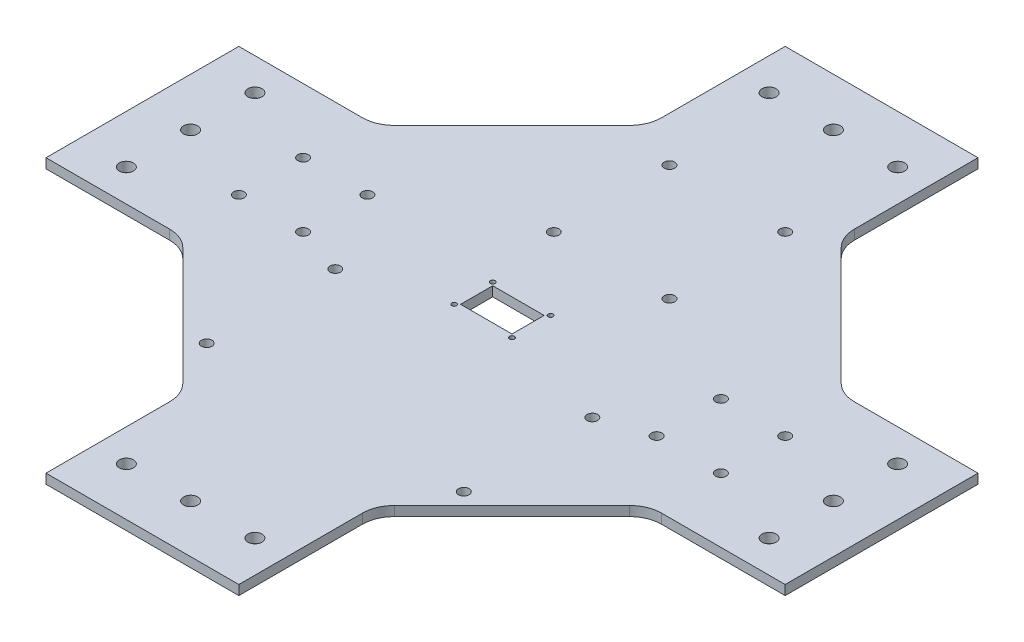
ISO-10303-21;
HEADER;
FILE_DESCRIPTION(('STEP AP214'),'2;1');
FILE_NAME('part.step','',(''),(''),'','','');
FILE_SCHEMA(('AUTOMOTIVE_DESIGN { 1 0 10303 214 1 1 1 1 }'));
ENDSEC;
DATA;
#1=APPLICATION_CONTEXT('core data for automotive mechanical design processes');
#2=APPLICATION_PROTOCOL_DEFINITION('international standard','automotive_design',2000,#1);
#3=PRODUCT_CONTEXT('',#1,'mechanical');
#4=PRODUCT('Part','Part','',(#3));
#5=PRODUCT_RELATED_PRODUCT_CATEGORY('part','',(#4));
#6=PRODUCT_DEFINITION_FORMATION('','',#4);
#7=PRODUCT_DEFINITION_CONTEXT('part definition',#1,'design');
#8=PRODUCT_DEFINITION('design','',#6,#7);
#9=PRODUCT_DEFINITION_SHAPE('','',#8);
#10=(LENGTH_UNIT() NAMED_UNIT(*) SI_UNIT(.MILLI.,.METRE.));
#11=(NAMED_UNIT(*) PLANE_ANGLE_UNIT() SI_UNIT($,.RADIAN.));
#12=(NAMED_UNIT(*) SI_UNIT($,.STERADIAN.) SOLID_ANGLE_UNIT());
#13=UNCERTAINTY_MEASURE_WITH_UNIT(LENGTH_MEASURE(1.E-05),#10,'distance_accuracy_value','');
#14=(GEOMETRIC_REPRESENTATION_CONTEXT(3) GLOBAL_UNCERTAINTY_ASSIGNED_CONTEXT((#13)) GLOBAL_UNIT_ASSIGNED_CONTEXT((#10,
#11,#12)) REPRESENTATION_CONTEXT('',''));
#15=CARTESIAN_POINT('',(0.,0.,0.));
#16=DIRECTION('',(0.,0.,1.));
#17=DIRECTION('',(1.,0.,0.));
#18=AXIS2_PLACEMENT_3D('',#15,#16,#17);
#19=CARTESIAN_POINT('',(5.,-7.,-5.));
#20=DIRECTION('',(-1.,0.,0.));
#21=DIRECTION('',(0.,1.,0.));
#22=AXIS2_PLACEMENT_3D('',#19,#20,#21);
#23=PLANE('',#22);
#24=DIRECTION('',(0.,0.,1.));
#25=VECTOR('',#24,1.);
#26=CARTESIAN_POINT('',(5.,0.,0.));
#27=LINE('',#26,#25);
#28=CARTESIAN_POINT('',(5.,0.,-5.));
#29=VERTEX_POINT('',#28);
#30=CARTESIAN_POINT('',(5.,0.,5.));
#31=VERTEX_POINT('',#30);
#32=EDGE_CURVE('E577',#29,#31,#27,.T.);
#33=ORIENTED_EDGE('',*,*,#32,.T.);
#34=DIRECTION('',(0.,1.,0.));
#35=VECTOR('',#34,1.);
#36=CARTESIAN_POINT('',(5.,-7.,5.));
#37=LINE('',#36,#35);
#38=CARTESIAN_POINT('',(5.,3.,5.));
#39=VERTEX_POINT('',#38);
#40=EDGE_CURVE('E48',#31,#39,#37,.T.);
#41=ORIENTED_EDGE('',*,*,#40,.T.);
#42=DIRECTION('',(0.,0.,1.));
#43=VECTOR('',#42,1.);
#44=CARTESIAN_POINT('',(5.,3.,-5.));
#45=LINE('',#44,#43);
#46=CARTESIAN_POINT('',(5.,3.,-5.));
#47=VERTEX_POINT('',#46);
#48=EDGE_CURVE('E547',#47,#39,#45,.T.);
#49=ORIENTED_EDGE('',*,*,#48,.F.);
#50=DIRECTION('',(0.,1.,0.));
#51=VECTOR('',#50,1.);
#52=CARTESIAN_POINT('',(5.,-7.,-5.));
#53=LINE('',#52,#51);
#54=EDGE_CURVE('E11',#29,#47,#53,.T.);
#55=ORIENTED_EDGE('',*,*,#54,.F.);
#56=EDGE_LOOP('',(#33,#41,#49,#55));
#57=FACE_BOUND('',#56,.T.);
#58=ADVANCED_FACE('F17',(#57),#23,.T.);
#59=CARTESIAN_POINT('',(-11.,-7.,-5.));
#60=DIRECTION('',(0.,0.,1.));
#61=DIRECTION('',(1.,0.,0.));
#62=AXIS2_PLACEMENT_3D('',#59,#60,#61);
#63=PLANE('',#62);
#64=DIRECTION('',(1.,0.,0.));
#65=VECTOR('',#64,1.);
#66=CARTESIAN_POINT('',(0.,0.,-5.));
#67=LINE('',#66,#65);
#68=CARTESIAN_POINT('',(-11.,0.,-5.));
#69=VERTEX_POINT('',#68);
#70=EDGE_CURVE('E580',#69,#29,#67,.T.);
#71=ORIENTED_EDGE('',*,*,#70,.T.);
#72=ORIENTED_EDGE('',*,*,#54,.T.);
#73=DIRECTION('',(1.,0.,0.));
#74=VECTOR('',#73,1.);
#75=CARTESIAN_POINT('',(-11.,3.,-5.));
#76=LINE('',#75,#74);
#77=CARTESIAN_POINT('',(-11.,3.,-5.));
#78=VERTEX_POINT('',#77);
#79=EDGE_CURVE('E546',#78,#47,#76,.T.);
#80=ORIENTED_EDGE('',*,*,#79,.F.);
#81=DIRECTION('',(0.,1.,0.));
#82=VECTOR('',#81,1.);
#83=CARTESIAN_POINT('',(-11.,-7.,-5.));
#84=LINE('',#83,#82);
#85=EDGE_CURVE('E26',#69,#78,#84,.T.);
#86=ORIENTED_EDGE('',*,*,#85,.F.);
#87=EDGE_LOOP('',(#71,#72,#80,#86));
#88=FACE_BOUND('',#87,.T.);
#89=ADVANCED_FACE('F19',(#88),#63,.T.);
#90=CARTESIAN_POINT('',(-11.,-7.,-5.));
#91=DIRECTION('',(-1.,0.,0.));
#92=DIRECTION('',(0.,1.,0.));
#93=AXIS2_PLACEMENT_3D('',#90,#91,#92);
#94=PLANE('',#93);
#95=ORIENTED_EDGE('',*,*,#85,.T.);
#96=DIRECTION('',(0.,0.,1.));
#97=VECTOR('',#96,1.);
#98=CARTESIAN_POINT('',(-11.,3.,-5.));
#99=LINE('',#98,#97);
#100=CARTESIAN_POINT('',(-11.,3.,5.));
#101=VERTEX_POINT('',#100);
#102=EDGE_CURVE('E542',#78,#101,#99,.T.);
#103=ORIENTED_EDGE('',*,*,#102,.T.);
#104=DIRECTION('',(0.,1.,0.));
#105=VECTOR('',#104,1.);
#106=CARTESIAN_POINT('',(-11.,-7.,5.));
#107=LINE('',#106,#105);
#108=CARTESIAN_POINT('',(-11.,0.,5.));
#109=VERTEX_POINT('',#108);
#110=EDGE_CURVE('E583',#109,#101,#107,.T.);
#111=ORIENTED_EDGE('',*,*,#110,.F.);
#112=DIRECTION('',(0.,0.,1.));
#113=VECTOR('',#112,1.);
#114=CARTESIAN_POINT('',(-11.,0.,0.));
#115=LINE('',#114,#113);
#116=EDGE_CURVE('E569',#69,#109,#115,.T.);
#117=ORIENTED_EDGE('',*,*,#116,.F.);
#118=EDGE_LOOP('',(#95,#103,#111,#117));
#119=FACE_BOUND('',#118,.T.);
#120=ADVANCED_FACE('F593',(#119),#94,.F.);
#121=CARTESIAN_POINT('',(-11.,-7.,5.));
#122=DIRECTION('',(0.,0.,1.));
#123=DIRECTION('',(1.,0.,0.));
#124=AXIS2_PLACEMENT_3D('',#121,#122,#123);
#125=PLANE('',#124);
#126=ORIENTED_EDGE('',*,*,#110,.T.);
#127=DIRECTION('',(1.,0.,0.));
#128=VECTOR('',#127,1.);
#129=CARTESIAN_POINT('',(-11.,3.,5.));
#130=LINE('',#129,#128);
#131=EDGE_CURVE('E392',#101,#39,#130,.T.);
#132=ORIENTED_EDGE('',*,*,#131,.T.);
#133=ORIENTED_EDGE('',*,*,#40,.F.);
#134=DIRECTION('',(1.,0.,0.));
#135=VECTOR('',#134,1.);
#136=CARTESIAN_POINT('',(0.,0.,5.));
#137=LINE('',#136,#135);
#138=EDGE_CURVE('E573',#109,#31,#137,.T.);
#139=ORIENTED_EDGE('',*,*,#138,.F.);
#140=EDGE_LOOP('',(#126,#132,#133,#139));
#141=FACE_BOUND('',#140,.T.);
#142=ADVANCED_FACE('F603',(#141),#125,.F.);
#143=CARTESIAN_POINT('',(-76.5685424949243,3.,39.9999999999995));
#144=DIRECTION('',(0.,-1.,0.));
#145=DIRECTION('',(0.,0.,-1.));
#146=AXIS2_PLACEMENT_3D('',#143,#144,#145);
#147=CYLINDRICAL_SURFACE('',#146,10.);
#148=CARTESIAN_POINT('',(-76.5685424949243,3.,39.9999999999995));
#149=DIRECTION('',(0.,-1.,0.));
#150=DIRECTION('',(0.,0.,1.));
#151=AXIS2_PLACEMENT_3D('',#148,#149,#150);
#152=CIRCLE('',#151,10.);
#153=CARTESIAN_POINT('',(-76.5685424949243,3.,29.9999999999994));
#154=VERTEX_POINT('',#153);
#155=CARTESIAN_POINT('',(-69.4974746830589,3.,32.928932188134));
#156=VERTEX_POINT('',#155);
#157=EDGE_CURVE('E281',#154,#156,#152,.T.);
#158=ORIENTED_EDGE('',*,*,#157,.F.);
#159=DIRECTION('',(0.,1.,0.));
#160=VECTOR('',#159,1.);
#161=CARTESIAN_POINT('',(-76.5685424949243,3.,29.9999999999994));
#162=LINE('',#161,#160);
#163=CARTESIAN_POINT('',(-76.5685424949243,0.,29.9999999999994));
#164=VERTEX_POINT('',#163);
#165=EDGE_CURVE('E335',#164,#154,#162,.T.);
#166=ORIENTED_EDGE('',*,*,#165,.F.);
#167=CARTESIAN_POINT('',(-76.5685424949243,0.,39.9999999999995));
#168=DIRECTION('',(0.,1.,0.));
#169=DIRECTION('',(0.,0.,1.));
#170=AXIS2_PLACEMENT_3D('',#167,#168,#169);
#171=CIRCLE('',#170,10.);
#172=CARTESIAN_POINT('',(-69.4974746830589,0.,32.928932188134));
#173=VERTEX_POINT('',#172);
#174=EDGE_CURVE('E551',#173,#164,#171,.T.);
#175=ORIENTED_EDGE('',*,*,#174,.F.);
#176=DIRECTION('',(0.,-1.,0.));
#177=VECTOR('',#176,1.);
#178=CARTESIAN_POINT('',(-69.4974746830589,3.,32.928932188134));
#179=LINE('',#178,#177);
#180=EDGE_CURVE('E298',#156,#173,#179,.T.);
#181=ORIENTED_EDGE('',*,*,#180,.F.);
#182=EDGE_LOOP('',(#158,#166,#175,#181));
#183=FACE_BOUND('',#182,.T.);
#184=ADVANCED_FACE('F743',(#183),#147,.F.);
#185=CARTESIAN_POINT('',(-40.,3.,76.5685424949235));
#186=DIRECTION('',(0.,1.,0.));
#187=DIRECTION('',(0.,0.,1.));
#188=AXIS2_PLACEMENT_3D('',#185,#186,#187);
#189=CYLINDRICAL_SURFACE('',#188,10.);
#190=CARTESIAN_POINT('',(-40.,3.,76.5685424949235));
#191=DIRECTION('',(0.,-1.,0.));
#192=DIRECTION('',(0.,0.,1.));
#193=AXIS2_PLACEMENT_3D('',#190,#191,#192);
#194=CIRCLE('',#193,10.);
#195=CARTESIAN_POINT('',(-32.9289321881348,3.,69.497474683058));
#196=VERTEX_POINT('',#195);
#197=CARTESIAN_POINT('',(-30.,3.,76.5685424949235));
#198=VERTEX_POINT('',#197);
#199=EDGE_CURVE('E267',#196,#198,#194,.T.);
#200=ORIENTED_EDGE('',*,*,#199,.F.);
#201=DIRECTION('',(0.,1.,0.));
#202=VECTOR('',#201,1.);
#203=CARTESIAN_POINT('',(-32.9289321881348,3.,69.497474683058));
#204=LINE('',#203,#202);
#205=CARTESIAN_POINT('',(-32.9289321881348,0.,69.497474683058));
#206=VERTEX_POINT('',#205);
#207=EDGE_CURVE('E352',#206,#196,#204,.T.);
#208=ORIENTED_EDGE('',*,*,#207,.F.);
#209=CARTESIAN_POINT('',(-40.,0.,76.5685424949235));
#210=DIRECTION('',(0.,1.,0.));
#211=DIRECTION('',(0.,0.,1.));
#212=AXIS2_PLACEMENT_3D('',#209,#210,#211);
#213=CIRCLE('',#212,10.);
#214=CARTESIAN_POINT('',(-30.,0.,76.5685424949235));
#215=VERTEX_POINT('',#214);
#216=EDGE_CURVE('E286',#215,#206,#213,.T.);
#217=ORIENTED_EDGE('',*,*,#216,.F.);
#218=DIRECTION('',(0.,-1.,0.));
#219=VECTOR('',#218,1.);
#220=CARTESIAN_POINT('',(-30.,0.,76.5685424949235));
#221=LINE('',#220,#219);
#222=EDGE_CURVE('E284',#198,#215,#221,.T.);
#223=ORIENTED_EDGE('',*,*,#222,.F.);
#224=EDGE_LOOP('',(#200,#208,#217,#223));
#225=FACE_BOUND('',#224,.T.);
#226=ADVANCED_FACE('F285',(#225),#189,.F.);
#227=CARTESIAN_POINT('',(40.,3.,76.568542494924));
#228=DIRECTION('',(0.,-1.,0.));
#229=DIRECTION('',(0.,0.,-1.));
#230=AXIS2_PLACEMENT_3D('',#227,#228,#229);
#231=CYLINDRICAL_SURFACE('',#230,10.);
#232=CARTESIAN_POINT('',(40.,3.,76.568542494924));
#233=DIRECTION('',(0.,-1.,0.));
#234=DIRECTION('',(0.,0.,1.));
#235=AXIS2_PLACEMENT_3D('',#232,#233,#234);
#236=CIRCLE('',#235,10.);
#237=CARTESIAN_POINT('',(30.,3.,76.5685424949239));
#238=VERTEX_POINT('',#237);
#239=CARTESIAN_POINT('',(32.9289321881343,3.,69.4974746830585));
#240=VERTEX_POINT('',#239);
#241=EDGE_CURVE('E280',#238,#240,#236,.T.);
#242=ORIENTED_EDGE('',*,*,#241,.F.);
#243=DIRECTION('',(0.,1.,0.));
#244=VECTOR('',#243,1.);
#245=CARTESIAN_POINT('',(30.,3.,76.5685424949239));
#246=LINE('',#245,#244);
#247=CARTESIAN_POINT('',(30.,0.,76.5685424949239));
#248=VERTEX_POINT('',#247);
#249=EDGE_CURVE('E375',#248,#238,#246,.T.);
#250=ORIENTED_EDGE('',*,*,#249,.F.);
#251=CARTESIAN_POINT('',(40.,0.,76.568542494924));
#252=DIRECTION('',(0.,1.,0.));
#253=DIRECTION('',(0.,0.,1.));
#254=AXIS2_PLACEMENT_3D('',#251,#252,#253);
#255=CIRCLE('',#254,10.);
#256=CARTESIAN_POINT('',(32.9289321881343,0.,69.4974746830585));
#257=VERTEX_POINT('',#256);
#258=EDGE_CURVE('E564',#257,#248,#255,.T.);
#259=ORIENTED_EDGE('',*,*,#258,.F.);
#260=DIRECTION('',(0.,-1.,0.));
#261=VECTOR('',#260,1.);
#262=CARTESIAN_POINT('',(32.9289321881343,3.,69.4974746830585));
#263=LINE('',#262,#261);
#264=EDGE_CURVE('E405',#240,#257,#263,.T.);
#265=ORIENTED_EDGE('',*,*,#264,.F.);
#266=EDGE_LOOP('',(#242,#250,#259,#265));
#267=FACE_BOUND('',#266,.T.);
#268=ADVANCED_FACE('F676',(#267),#231,.F.);
#269=CARTESIAN_POINT('',(76.5685424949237,3.,40.));
#270=DIRECTION('',(0.,1.,0.));
#271=DIRECTION('',(0.,0.,1.));
#272=AXIS2_PLACEMENT_3D('',#269,#270,#271);
#273=CYLINDRICAL_SURFACE('',#272,10.);
#274=CARTESIAN_POINT('',(76.5685424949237,3.,40.));
#275=DIRECTION('',(0.,-1.,0.));
#276=DIRECTION('',(0.,0.,1.));
#277=AXIS2_PLACEMENT_3D('',#274,#275,#276);
#278=CIRCLE('',#277,10.);
#279=CARTESIAN_POINT('',(69.4974746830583,3.,32.9289321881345));
#280=VERTEX_POINT('',#279);
#281=CARTESIAN_POINT('',(76.5685424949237,3.,30.));
#282=VERTEX_POINT('',#281);
#283=EDGE_CURVE('E518',#280,#282,#278,.T.);
#284=ORIENTED_EDGE('',*,*,#283,.F.);
#285=DIRECTION('',(0.,1.,0.));
#286=VECTOR('',#285,1.);
#287=CARTESIAN_POINT('',(69.4974746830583,3.,32.9289321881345));
#288=LINE('',#287,#286);
#289=CARTESIAN_POINT('',(69.4974746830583,0.,32.9289321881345));
#290=VERTEX_POINT('',#289);
#291=EDGE_CURVE('E397',#290,#280,#288,.T.);
#292=ORIENTED_EDGE('',*,*,#291,.F.);
#293=CARTESIAN_POINT('',(76.5685424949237,0.,40.));
#294=DIRECTION('',(0.,1.,0.));
#295=DIRECTION('',(0.,0.,1.));
#296=AXIS2_PLACEMENT_3D('',#293,#294,#295);
#297=CIRCLE('',#296,10.);
#298=CARTESIAN_POINT('',(76.5685424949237,0.,30.));
#299=VERTEX_POINT('',#298);
#300=EDGE_CURVE('E561',#299,#290,#297,.T.);
#301=ORIENTED_EDGE('',*,*,#300,.F.);
#302=DIRECTION('',(0.,-1.,0.));
#303=VECTOR('',#302,1.);
#304=CARTESIAN_POINT('',(76.5685424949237,0.,30.));
#305=LINE('',#304,#303);
#306=EDGE_CURVE('E410',#282,#299,#305,.T.);
#307=ORIENTED_EDGE('',*,*,#306,.F.);
#308=EDGE_LOOP('',(#284,#292,#301,#307));
#309=FACE_BOUND('',#308,.T.);
#310=ADVANCED_FACE('F672',(#309),#273,.F.);
#311=CARTESIAN_POINT('',(76.5685424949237,3.,-40.));
#312=DIRECTION('',(0.,-1.,0.));
#313=DIRECTION('',(0.,0.,-1.));
#314=AXIS2_PLACEMENT_3D('',#311,#312,#313);
#315=CYLINDRICAL_SURFACE('',#314,10.);
#316=CARTESIAN_POINT('',(76.5685424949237,3.,-40.));
#317=DIRECTION('',(0.,-1.,0.));
#318=DIRECTION('',(0.,0.,1.));
#319=AXIS2_PLACEMENT_3D('',#316,#317,#318);
#320=CIRCLE('',#319,10.);
#321=CARTESIAN_POINT('',(76.5685424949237,3.,-30.));
#322=VERTEX_POINT('',#321);
#323=CARTESIAN_POINT('',(69.4974746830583,3.,-32.9289321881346));
#324=VERTEX_POINT('',#323);
#325=EDGE_CURVE('E534',#322,#324,#320,.T.);
#326=ORIENTED_EDGE('',*,*,#325,.F.);
#327=DIRECTION('',(0.,1.,0.));
#328=VECTOR('',#327,1.);
#329=CARTESIAN_POINT('',(76.5685424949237,3.,-30.));
#330=LINE('',#329,#328);
#331=CARTESIAN_POINT('',(76.5685424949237,0.,-30.));
#332=VERTEX_POINT('',#331);
#333=EDGE_CURVE('E437',#332,#322,#330,.T.);
#334=ORIENTED_EDGE('',*,*,#333,.F.);
#335=CARTESIAN_POINT('',(76.5685424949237,0.,-40.));
#336=DIRECTION('',(0.,1.,0.));
#337=DIRECTION('',(0.,0.,1.));
#338=AXIS2_PLACEMENT_3D('',#335,#336,#337);
#339=CIRCLE('',#338,10.);
#340=CARTESIAN_POINT('',(69.4974746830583,0.,-32.9289321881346));
#341=VERTEX_POINT('',#340);
#342=EDGE_CURVE('E530',#341,#332,#339,.T.);
#343=ORIENTED_EDGE('',*,*,#342,.F.);
#344=DIRECTION('',(0.,-1.,0.));
#345=VECTOR('',#344,1.);
#346=CARTESIAN_POINT('',(69.4974746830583,3.,-32.9289321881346));
#347=LINE('',#346,#345);
#348=EDGE_CURVE('E453',#324,#341,#347,.T.);
#349=ORIENTED_EDGE('',*,*,#348,.F.);
#350=EDGE_LOOP('',(#326,#334,#343,#349));
#351=FACE_BOUND('',#350,.T.);
#352=ADVANCED_FACE('F675',(#351),#315,.F.);
#353=CARTESIAN_POINT('',(40.0000000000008,3.,-76.5685424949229));
#354=DIRECTION('',(0.,1.,0.));
#355=DIRECTION('',(0.,0.,1.));
#356=AXIS2_PLACEMENT_3D('',#353,#354,#355);
#357=CYLINDRICAL_SURFACE('',#356,10.);
#358=CARTESIAN_POINT('',(40.0000000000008,3.,-76.5685424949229));
#359=DIRECTION('',(0.,-1.,0.));
#360=DIRECTION('',(0.,0.,1.));
#361=AXIS2_PLACEMENT_3D('',#358,#359,#360);
#362=CIRCLE('',#361,10.);
#363=CARTESIAN_POINT('',(32.9289321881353,3.,-69.4974746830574));
#364=VERTEX_POINT('',#363);
#365=CARTESIAN_POINT('',(30.0000000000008,3.,-76.568542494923));
#366=VERTEX_POINT('',#365);
#367=EDGE_CURVE('E537',#364,#366,#362,.T.);
#368=ORIENTED_EDGE('',*,*,#367,.F.);
#369=DIRECTION('',(0.,1.,0.));
#370=VECTOR('',#369,1.);
#371=CARTESIAN_POINT('',(32.9289321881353,3.,-69.4974746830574));
#372=LINE('',#371,#370);
#373=CARTESIAN_POINT('',(32.9289321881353,0.,-69.4974746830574));
#374=VERTEX_POINT('',#373);
#375=EDGE_CURVE('E448',#374,#364,#372,.T.);
#376=ORIENTED_EDGE('',*,*,#375,.F.);
#377=CARTESIAN_POINT('',(40.0000000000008,0.,-76.5685424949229));
#378=DIRECTION('',(0.,1.,0.));
#379=DIRECTION('',(0.,0.,1.));
#380=AXIS2_PLACEMENT_3D('',#377,#378,#379);
#381=CIRCLE('',#380,10.);
#382=CARTESIAN_POINT('',(30.0000000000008,0.,-76.568542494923));
#383=VERTEX_POINT('',#382);
#384=EDGE_CURVE('E527',#383,#374,#381,.T.);
#385=ORIENTED_EDGE('',*,*,#384,.F.);
#386=DIRECTION('',(0.,-1.,0.));
#387=VECTOR('',#386,1.);
#388=CARTESIAN_POINT('',(30.0000000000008,0.,-76.568542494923));
#389=LINE('',#388,#387);
#390=EDGE_CURVE('E461',#366,#383,#389,.T.);
#391=ORIENTED_EDGE('',*,*,#390,.F.);
#392=EDGE_LOOP('',(#368,#376,#385,#391));
#393=FACE_BOUND('',#392,.T.);
#394=ADVANCED_FACE('F740',(#393),#357,.F.);
#395=CARTESIAN_POINT('',(-76.5685424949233,3.,-40.0000000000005));
#396=DIRECTION('',(0.,1.,0.));
#397=DIRECTION('',(0.,0.,1.));
#398=AXIS2_PLACEMENT_3D('',#395,#396,#397);
#399=CYLINDRICAL_SURFACE('',#398,10.);
#400=CARTESIAN_POINT('',(-76.5685424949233,3.,-40.0000000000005));
#401=DIRECTION('',(0.,-1.,0.));
#402=DIRECTION('',(0.,0.,1.));
#403=AXIS2_PLACEMENT_3D('',#400,#401,#402);
#404=CIRCLE('',#403,10.);
#405=CARTESIAN_POINT('',(-69.4974746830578,3.,-32.9289321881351));
#406=VERTEX_POINT('',#405);
#407=CARTESIAN_POINT('',(-76.5685424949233,3.,-30.0000000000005));
#408=VERTEX_POINT('',#407);
#409=EDGE_CURVE('E389',#406,#408,#404,.T.);
#410=ORIENTED_EDGE('',*,*,#409,.F.);
#411=DIRECTION('',(0.,1.,0.));
#412=VECTOR('',#411,1.);
#413=CARTESIAN_POINT('',(-69.4974746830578,3.,-32.9289321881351));
#414=LINE('',#413,#412);
#415=CARTESIAN_POINT('',(-69.4974746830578,0.,-32.9289321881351));
#416=VERTEX_POINT('',#415);
#417=EDGE_CURVE('E502',#416,#406,#414,.T.);
#418=ORIENTED_EDGE('',*,*,#417,.F.);
#419=CARTESIAN_POINT('',(-76.5685424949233,0.,-40.0000000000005));
#420=DIRECTION('',(0.,1.,0.));
#421=DIRECTION('',(0.,0.,1.));
#422=AXIS2_PLACEMENT_3D('',#419,#420,#421);
#423=CIRCLE('',#422,10.);
#424=CARTESIAN_POINT('',(-76.5685424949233,0.,-30.0000000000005));
#425=VERTEX_POINT('',#424);
#426=EDGE_CURVE('E554',#425,#416,#423,.T.);
#427=ORIENTED_EDGE('',*,*,#426,.F.);
#428=DIRECTION('',(0.,-1.,0.));
#429=VECTOR('',#428,1.);
#430=CARTESIAN_POINT('',(-76.5685424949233,0.,-30.0000000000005));
#431=LINE('',#430,#429);
#432=EDGE_CURVE('E380',#408,#425,#431,.T.);
#433=ORIENTED_EDGE('',*,*,#432,.F.);
#434=EDGE_LOOP('',(#410,#418,#427,#433));
#435=FACE_BOUND('',#434,.T.);
#436=ADVANCED_FACE('F736',(#435),#399,.F.);
#437=CARTESIAN_POINT('',(-39.9999999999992,3.,-76.5685424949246));
#438=DIRECTION('',(0.,-1.,0.));
#439=DIRECTION('',(0.,0.,-1.));
#440=AXIS2_PLACEMENT_3D('',#437,#438,#439);
#441=CYLINDRICAL_SURFACE('',#440,10.);
#442=CARTESIAN_POINT('',(-39.9999999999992,3.,-76.5685424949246));
#443=DIRECTION('',(0.,-1.,0.));
#444=DIRECTION('',(0.,0.,1.));
#445=AXIS2_PLACEMENT_3D('',#442,#443,#444);
#446=CIRCLE('',#445,10.);
#447=CARTESIAN_POINT('',(-29.9999999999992,3.,-76.5685424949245));
#448=VERTEX_POINT('',#447);
#449=CARTESIAN_POINT('',(-32.9289321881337,3.,-69.4974746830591));
#450=VERTEX_POINT('',#449);
#451=EDGE_CURVE('E393',#448,#450,#446,.T.);
#452=ORIENTED_EDGE('',*,*,#451,.F.);
#453=DIRECTION('',(0.,1.,0.));
#454=VECTOR('',#453,1.);
#455=CARTESIAN_POINT('',(-29.9999999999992,3.,-76.5685424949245));
#456=LINE('',#455,#454);
#457=CARTESIAN_POINT('',(-29.9999999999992,0.,-76.5685424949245));
#458=VERTEX_POINT('',#457);
#459=EDGE_CURVE('E483',#458,#448,#456,.T.);
#460=ORIENTED_EDGE('',*,*,#459,.F.);
#461=CARTESIAN_POINT('',(-39.9999999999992,0.,-76.5685424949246));
#462=DIRECTION('',(0.,1.,0.));
#463=DIRECTION('',(0.,0.,1.));
#464=AXIS2_PLACEMENT_3D('',#461,#462,#463);
#465=CIRCLE('',#464,10.);
#466=CARTESIAN_POINT('',(-32.9289321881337,0.,-69.4974746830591));
#467=VERTEX_POINT('',#466);
#468=EDGE_CURVE('E531',#467,#458,#465,.T.);
#469=ORIENTED_EDGE('',*,*,#468,.F.);
#470=DIRECTION('',(0.,-1.,0.));
#471=VECTOR('',#470,1.);
#472=CARTESIAN_POINT('',(-32.9289321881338,3.,-69.4974746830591));
#473=LINE('',#472,#471);
#474=EDGE_CURVE('E494',#450,#467,#473,.T.);
#475=ORIENTED_EDGE('',*,*,#474,.F.);
#476=EDGE_LOOP('',(#452,#460,#469,#475));
#477=FACE_BOUND('',#476,.T.);
#478=ADVANCED_FACE('F732',(#477),#441,.F.);
#479=CARTESIAN_POINT('',(0.,0.,0.));
#480=DIRECTION('',(0.,1.,0.));
#481=DIRECTION('',(1.,0.,0.));
#482=AXIS2_PLACEMENT_3D('',#479,#480,#481);
#483=PLANE('',#482);
#484=CARTESIAN_POINT('',(20.,0.,100.));
#485=DIRECTION('',(0.,1.,0.));
#486=DIRECTION('',(0.,0.,1.));
#487=AXIS2_PLACEMENT_3D('',#484,#485,#486);
#488=CIRCLE('',#487,2.2);
#489=CARTESIAN_POINT('',(20.,0.,102.2));
#490=VERTEX_POINT('',#489);
#491=EDGE_CURVE('E815',#490,#490,#488,.T.);
#492=ORIENTED_EDGE('',*,*,#491,.T.);
#493=EDGE_LOOP('',(#492));
#494=FACE_BOUND('',#493,.T.);
#495=CARTESIAN_POINT('',(0.,0.,100.));
#496=DIRECTION('',(0.,1.,0.));
#497=DIRECTION('',(0.,0.,1.));
#498=AXIS2_PLACEMENT_3D('',#495,#496,#497);
#499=CIRCLE('',#498,2.2);
#500=CARTESIAN_POINT('',(0.,0.,102.2));
#501=VERTEX_POINT('',#500);
#502=EDGE_CURVE('E336',#501,#501,#499,.T.);
#503=ORIENTED_EDGE('',*,*,#502,.T.);
#504=EDGE_LOOP('',(#503));
#505=FACE_BOUND('',#504,.T.);
#506=CARTESIAN_POINT('',(-20.,0.,100.));
#507=DIRECTION('',(0.,1.,0.));
#508=DIRECTION('',(0.,0.,1.));
#509=AXIS2_PLACEMENT_3D('',#506,#507,#508);
#510=CIRCLE('',#509,2.2);
#511=CARTESIAN_POINT('',(-20.,0.,102.2));
#512=VERTEX_POINT('',#511);
#513=EDGE_CURVE('E898',#512,#512,#510,.T.);
#514=ORIENTED_EDGE('',*,*,#513,.T.);
#515=EDGE_LOOP('',(#514));
#516=FACE_BOUND('',#515,.T.);
#517=CARTESIAN_POINT('',(100.,0.,-20.));
#518=DIRECTION('',(0.,1.,0.));
#519=DIRECTION('',(0.,0.,1.));
#520=AXIS2_PLACEMENT_3D('',#517,#518,#519);
#521=CIRCLE('',#520,2.2);
#522=CARTESIAN_POINT('',(100.,0.,-17.8));
#523=VERTEX_POINT('',#522);
#524=EDGE_CURVE('E1016',#523,#523,#521,.T.);
#525=ORIENTED_EDGE('',*,*,#524,.T.);
#526=EDGE_LOOP('',(#525));
#527=FACE_BOUND('',#526,.T.);
#528=CARTESIAN_POINT('',(100.,0.,0.));
#529=DIRECTION('',(0.,1.,0.));
#530=DIRECTION('',(0.,0.,1.));
#531=AXIS2_PLACEMENT_3D('',#528,#529,#530);
#532=CIRCLE('',#531,2.2);
#533=CARTESIAN_POINT('',(100.,0.,2.19999999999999));
#534=VERTEX_POINT('',#533);
#535=EDGE_CURVE('E326',#534,#534,#532,.T.);
#536=ORIENTED_EDGE('',*,*,#535,.T.);
#537=EDGE_LOOP('',(#536));
#538=FACE_BOUND('',#537,.T.);
#539=CARTESIAN_POINT('',(100.,0.,20.));
#540=DIRECTION('',(0.,1.,0.));
#541=DIRECTION('',(0.,0.,1.));
#542=AXIS2_PLACEMENT_3D('',#539,#540,#541);
#543=CIRCLE('',#542,2.2);
#544=CARTESIAN_POINT('',(100.,0.,22.2));
#545=VERTEX_POINT('',#544);
#546=EDGE_CURVE('E321',#545,#545,#543,.T.);
#547=ORIENTED_EDGE('',*,*,#546,.T.);
#548=EDGE_LOOP('',(#547));
#549=FACE_BOUND('',#548,.T.);
#550=CARTESIAN_POINT('',(0.,0.,-100.));
#551=DIRECTION('',(0.,1.,0.));
#552=DIRECTION('',(0.,0.,1.));
#553=AXIS2_PLACEMENT_3D('',#550,#551,#552);
#554=CIRCLE('',#553,2.2);
#555=CARTESIAN_POINT('',(0.,0.,-97.8));
#556=VERTEX_POINT('',#555);
#557=EDGE_CURVE('E316',#556,#556,#554,.T.);
#558=ORIENTED_EDGE('',*,*,#557,.T.);
#559=EDGE_LOOP('',(#558));
#560=FACE_BOUND('',#559,.T.);
#561=CARTESIAN_POINT('',(-20.,0.,-100.));
#562=DIRECTION('',(0.,1.,0.));
#563=DIRECTION('',(0.,0.,1.));
#564=AXIS2_PLACEMENT_3D('',#561,#562,#563);
#565=CIRCLE('',#564,2.2);
#566=CARTESIAN_POINT('',(-20.,0.,-97.8));
#567=VERTEX_POINT('',#566);
#568=EDGE_CURVE('E310',#567,#567,#565,.T.);
#569=ORIENTED_EDGE('',*,*,#568,.T.);
#570=EDGE_LOOP('',(#569));
#571=FACE_BOUND('',#570,.T.);
#572=CARTESIAN_POINT('',(20.,0.,-100.));
#573=DIRECTION('',(0.,1.,0.));
#574=DIRECTION('',(0.,0.,1.));
#575=AXIS2_PLACEMENT_3D('',#572,#573,#574);
#576=CIRCLE('',#575,2.2);
#577=CARTESIAN_POINT('',(20.,0.,-97.8));
#578=VERTEX_POINT('',#577);
#579=EDGE_CURVE('E308',#578,#578,#576,.T.);
#580=ORIENTED_EDGE('',*,*,#579,.T.);
#581=EDGE_LOOP('',(#580));
#582=FACE_BOUND('',#581,.T.);
#583=CARTESIAN_POINT('',(-100.,0.,20.));
#584=DIRECTION('',(0.,1.,0.));
#585=DIRECTION('',(0.,0.,1.));
#586=AXIS2_PLACEMENT_3D('',#583,#584,#585);
#587=CIRCLE('',#586,2.2);
#588=CARTESIAN_POINT('',(-100.,0.,22.2));
#589=VERTEX_POINT('',#588);
#590=EDGE_CURVE('E824',#589,#589,#587,.T.);
#591=ORIENTED_EDGE('',*,*,#590,.T.);
#592=EDGE_LOOP('',(#591));
#593=FACE_BOUND('',#592,.T.);
#594=CARTESIAN_POINT('',(-100.,0.,0.));
#595=DIRECTION('',(0.,1.,0.));
#596=DIRECTION('',(0.,0.,1.));
#597=AXIS2_PLACEMENT_3D('',#594,#595,#596);
#598=CIRCLE('',#597,2.2);
#599=CARTESIAN_POINT('',(-100.,0.,2.19999999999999));
#600=VERTEX_POINT('',#599);
#601=EDGE_CURVE('E835',#600,#600,#598,.T.);
#602=ORIENTED_EDGE('',*,*,#601,.T.);
#603=EDGE_LOOP('',(#602));
#604=FACE_BOUND('',#603,.T.);
#605=CARTESIAN_POINT('',(-100.,0.,-20.));
#606=DIRECTION('',(0.,1.,0.));
#607=DIRECTION('',(0.,0.,1.));
#608=AXIS2_PLACEMENT_3D('',#605,#606,#607);
#609=CIRCLE('',#608,2.2);
#610=CARTESIAN_POINT('',(-100.,0.,-17.8));
#611=VERTEX_POINT('',#610);
#612=EDGE_CURVE('E856',#611,#611,#609,.T.);
#613=ORIENTED_EDGE('',*,*,#612,.T.);
#614=EDGE_LOOP('',(#613));
#615=FACE_BOUND('',#614,.T.);
#616=ORIENTED_EDGE('',*,*,#116,.T.);
#617=ORIENTED_EDGE('',*,*,#138,.T.);
#618=ORIENTED_EDGE('',*,*,#32,.F.);
#619=ORIENTED_EDGE('',*,*,#70,.F.);
#620=EDGE_LOOP('',(#616,#617,#618,#619));
#621=FACE_BOUND('',#620,.T.);
#622=CARTESIAN_POINT('',(-12.,0.,6.));
#623=DIRECTION('',(0.,1.,0.));
#624=DIRECTION('',(0.,0.,1.));
#625=AXIS2_PLACEMENT_3D('',#622,#623,#624);
#626=CIRCLE('',#625,0.75);
#627=CARTESIAN_POINT('',(-12.,0.,6.75));
#628=VERTEX_POINT('',#627);
#629=EDGE_CURVE('E802',#628,#628,#626,.T.);
#630=ORIENTED_EDGE('',*,*,#629,.T.);
#631=EDGE_LOOP('',(#630));
#632=FACE_BOUND('',#631,.T.);
#633=CARTESIAN_POINT('',(6.,0.,6.));
#634=DIRECTION('',(0.,1.,0.));
#635=DIRECTION('',(0.,0.,1.));
#636=AXIS2_PLACEMENT_3D('',#633,#634,#635);
#637=CIRCLE('',#636,0.75);
#638=CARTESIAN_POINT('',(6.,0.,6.75));
#639=VERTEX_POINT('',#638);
#640=EDGE_CURVE('E793',#639,#639,#637,.T.);
#641=ORIENTED_EDGE('',*,*,#640,.T.);
#642=EDGE_LOOP('',(#641));
#643=FACE_BOUND('',#642,.T.);
#644=CARTESIAN_POINT('',(6.,0.,-6.));
#645=DIRECTION('',(0.,1.,0.));
#646=DIRECTION('',(0.,0.,1.));
#647=AXIS2_PLACEMENT_3D('',#644,#645,#646);
#648=CIRCLE('',#647,0.75);
#649=CARTESIAN_POINT('',(6.,0.,-5.25));
#650=VERTEX_POINT('',#649);
#651=EDGE_CURVE('E805',#650,#650,#648,.T.);
#652=ORIENTED_EDGE('',*,*,#651,.T.);
#653=EDGE_LOOP('',(#652));
#654=FACE_BOUND('',#653,.T.);
#655=CARTESIAN_POINT('',(-12.,0.,-6.));
#656=DIRECTION('',(0.,1.,0.));
#657=DIRECTION('',(0.,0.,1.));
#658=AXIS2_PLACEMENT_3D('',#655,#656,#657);
#659=CIRCLE('',#658,0.75);
#660=CARTESIAN_POINT('',(-12.,0.,-5.25));
#661=VERTEX_POINT('',#660);
#662=EDGE_CURVE('E894',#661,#661,#659,.T.);
#663=ORIENTED_EDGE('',*,*,#662,.T.);
#664=EDGE_LOOP('',(#663));
#665=FACE_BOUND('',#664,.T.);
#666=CARTESIAN_POINT('',(-15.9999999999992,0.,-65.));
#667=DIRECTION('',(0.,1.,0.));
#668=DIRECTION('',(0.,0.,1.));
#669=AXIS2_PLACEMENT_3D('',#666,#667,#668);
#670=CIRCLE('',#669,1.65);
#671=CARTESIAN_POINT('',(-15.9999999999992,0.,-63.35));
#672=VERTEX_POINT('',#671);
#673=EDGE_CURVE('E881',#672,#672,#670,.T.);
#674=ORIENTED_EDGE('',*,*,#673,.T.);
#675=EDGE_LOOP('',(#674));
#676=FACE_BOUND('',#675,.T.);
#677=CARTESIAN_POINT('',(20.0000000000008,0.,-65.));
#678=DIRECTION('',(0.,1.,0.));
#679=DIRECTION('',(0.,0.,1.));
#680=AXIS2_PLACEMENT_3D('',#677,#678,#679);
#681=CIRCLE('',#680,1.65);
#682=CARTESIAN_POINT('',(20.0000000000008,0.,-63.35));
#683=VERTEX_POINT('',#682);
#684=EDGE_CURVE('E876',#683,#683,#681,.T.);
#685=ORIENTED_EDGE('',*,*,#684,.T.);
#686=EDGE_LOOP('',(#685));
#687=FACE_BOUND('',#686,.T.);
#688=CARTESIAN_POINT('',(20.0000000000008,0.,-29.));
#689=DIRECTION('',(0.,1.,0.));
#690=DIRECTION('',(0.,0.,1.));
#691=AXIS2_PLACEMENT_3D('',#688,#689,#690);
#692=CIRCLE('',#691,1.65);
#693=CARTESIAN_POINT('',(20.0000000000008,0.,-27.35));
#694=VERTEX_POINT('',#693);
#695=EDGE_CURVE('E870',#694,#694,#692,.T.);
#696=ORIENTED_EDGE('',*,*,#695,.T.);
#697=EDGE_LOOP('',(#696));
#698=FACE_BOUND('',#697,.T.);
#699=CARTESIAN_POINT('',(-15.9999999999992,0.,-29.));
#700=DIRECTION('',(0.,1.,0.));
#701=DIRECTION('',(0.,0.,1.));
#702=AXIS2_PLACEMENT_3D('',#699,#700,#701);
#703=CIRCLE('',#702,1.65);
#704=CARTESIAN_POINT('',(-15.9999999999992,0.,-27.35));
#705=VERTEX_POINT('',#704);
#706=EDGE_CURVE('E1008',#705,#705,#703,.T.);
#707=ORIENTED_EDGE('',*,*,#706,.T.);
#708=EDGE_LOOP('',(#707));
#709=FACE_BOUND('',#708,.T.);
#710=CARTESIAN_POINT('',(40.,0.,15.));
#711=DIRECTION('',(0.,1.,0.));
#712=DIRECTION('',(0.,0.,1.));
#713=AXIS2_PLACEMENT_3D('',#710,#711,#712);
#714=CIRCLE('',#713,1.65);
#715=CARTESIAN_POINT('',(40.,0.,16.65));
#716=VERTEX_POINT('',#715);
#717=EDGE_CURVE('E1009',#716,#716,#714,.T.);
#718=ORIENTED_EDGE('',*,*,#717,.T.);
#719=EDGE_LOOP('',(#718));
#720=FACE_BOUND('',#719,.T.);
#721=CARTESIAN_POINT('',(75.,0.,-10.));
#722=DIRECTION('',(0.,1.,0.));
#723=DIRECTION('',(0.,0.,1.));
#724=AXIS2_PLACEMENT_3D('',#721,#722,#723);
#725=CIRCLE('',#724,1.65);
#726=CARTESIAN_POINT('',(75.,0.,-8.35));
#727=VERTEX_POINT('',#726);
#728=EDGE_CURVE('E1118',#727,#727,#725,.T.);
#729=ORIENTED_EDGE('',*,*,#728,.T.);
#730=EDGE_LOOP('',(#729));
#731=FACE_BOUND('',#730,.T.);
#732=CARTESIAN_POINT('',(75.,0.,10.));
#733=DIRECTION('',(0.,1.,0.));
#734=DIRECTION('',(0.,0.,1.));
#735=AXIS2_PLACEMENT_3D('',#732,#733,#734);
#736=CIRCLE('',#735,1.65);
#737=CARTESIAN_POINT('',(75.,0.,11.65));
#738=VERTEX_POINT('',#737);
#739=EDGE_CURVE('E1051',#738,#738,#736,.T.);
#740=ORIENTED_EDGE('',*,*,#739,.T.);
#741=EDGE_LOOP('',(#740));
#742=FACE_BOUND('',#741,.T.);
#743=CARTESIAN_POINT('',(55.,0.,10.));
#744=DIRECTION('',(0.,1.,0.));
#745=DIRECTION('',(0.,0.,1.));
#746=AXIS2_PLACEMENT_3D('',#743,#744,#745);
#747=CIRCLE('',#746,1.65);
#748=CARTESIAN_POINT('',(55.,0.,11.65));
#749=VERTEX_POINT('',#748);
#750=EDGE_CURVE('E1097',#749,#749,#747,.T.);
#751=ORIENTED_EDGE('',*,*,#750,.T.);
#752=EDGE_LOOP('',(#751));
#753=FACE_BOUND('',#752,.T.);
#754=CARTESIAN_POINT('',(40.,0.,55.));
#755=DIRECTION('',(0.,1.,0.));
#756=DIRECTION('',(0.,0.,1.));
#757=AXIS2_PLACEMENT_3D('',#754,#755,#756);
#758=CIRCLE('',#757,1.65);
#759=CARTESIAN_POINT('',(40.,0.,56.65));
#760=VERTEX_POINT('',#759);
#761=EDGE_CURVE('E1089',#760,#760,#758,.T.);
#762=ORIENTED_EDGE('',*,*,#761,.T.);
#763=EDGE_LOOP('',(#762));
#764=FACE_BOUND('',#763,.T.);
#765=CARTESIAN_POINT('',(-40.,0.,55.));
#766=DIRECTION('',(0.,1.,0.));
#767=DIRECTION('',(0.,0.,1.));
#768=AXIS2_PLACEMENT_3D('',#765,#766,#767);
#769=CIRCLE('',#768,1.65);
#770=CARTESIAN_POINT('',(-40.,0.,56.65));
#771=VERTEX_POINT('',#770);
#772=EDGE_CURVE('E1077',#771,#771,#769,.T.);
#773=ORIENTED_EDGE('',*,*,#772,.T.);
#774=EDGE_LOOP('',(#773));
#775=FACE_BOUND('',#774,.T.);
#776=CARTESIAN_POINT('',(-40.,0.,15.));
#777=DIRECTION('',(0.,1.,0.));
#778=DIRECTION('',(0.,0.,1.));
#779=AXIS2_PLACEMENT_3D('',#776,#777,#778);
#780=CIRCLE('',#779,1.65);
#781=CARTESIAN_POINT('',(-40.,0.,16.65));
#782=VERTEX_POINT('',#781);
#783=EDGE_CURVE('E1060',#782,#782,#780,.T.);
#784=ORIENTED_EDGE('',*,*,#783,.T.);
#785=EDGE_LOOP('',(#784));
#786=FACE_BOUND('',#785,.T.);
#787=CARTESIAN_POINT('',(-75.,0.,-10.));
#788=DIRECTION('',(0.,1.,0.));
#789=DIRECTION('',(0.,0.,1.));
#790=AXIS2_PLACEMENT_3D('',#787,#788,#789);
#791=CIRCLE('',#790,1.65);
#792=CARTESIAN_POINT('',(-75.,0.,-8.35));
#793=VERTEX_POINT('',#792);
#794=EDGE_CURVE('E1027',#793,#793,#791,.T.);
#795=ORIENTED_EDGE('',*,*,#794,.T.);
#796=EDGE_LOOP('',(#795));
#797=FACE_BOUND('',#796,.T.);
#798=CARTESIAN_POINT('',(55.,0.,-10.));
#799=DIRECTION('',(0.,1.,0.));
#800=DIRECTION('',(0.,0.,1.));
#801=AXIS2_PLACEMENT_3D('',#798,#799,#800);
#802=CIRCLE('',#801,1.65);
#803=CARTESIAN_POINT('',(55.,0.,-8.35));
#804=VERTEX_POINT('',#803);
#805=EDGE_CURVE('E1028',#804,#804,#802,.T.);
#806=ORIENTED_EDGE('',*,*,#805,.T.);
#807=EDGE_LOOP('',(#806));
#808=FACE_BOUND('',#807,.T.);
#809=CARTESIAN_POINT('',(-75.,0.,10.));
#810=DIRECTION('',(0.,1.,0.));
#811=DIRECTION('',(0.,0.,1.));
#812=AXIS2_PLACEMENT_3D('',#809,#810,#811);
#813=CIRCLE('',#812,1.65);
#814=CARTESIAN_POINT('',(-75.,0.,11.65));
#815=VERTEX_POINT('',#814);
#816=EDGE_CURVE('E998',#815,#815,#813,.T.);
#817=ORIENTED_EDGE('',*,*,#816,.T.);
#818=EDGE_LOOP('',(#817));
#819=FACE_BOUND('',#818,.T.);
#820=CARTESIAN_POINT('',(-55.,0.,10.));
#821=DIRECTION('',(0.,1.,0.));
#822=DIRECTION('',(0.,0.,1.));
#823=AXIS2_PLACEMENT_3D('',#820,#821,#822);
#824=CIRCLE('',#823,1.65);
#825=CARTESIAN_POINT('',(-55.,0.,11.65));
#826=VERTEX_POINT('',#825);
#827=EDGE_CURVE('E995',#826,#826,#824,.T.);
#828=ORIENTED_EDGE('',*,*,#827,.T.);
#829=EDGE_LOOP('',(#828));
#830=FACE_BOUND('',#829,.T.);
#831=CARTESIAN_POINT('',(-55.,0.,-10.));
#832=DIRECTION('',(0.,1.,0.));
#833=DIRECTION('',(0.,0.,1.));
#834=AXIS2_PLACEMENT_3D('',#831,#832,#833);
#835=CIRCLE('',#834,1.65);
#836=CARTESIAN_POINT('',(-55.,0.,-8.35));
#837=VERTEX_POINT('',#836);
#838=EDGE_CURVE('E988',#837,#837,#835,.T.);
#839=ORIENTED_EDGE('',*,*,#838,.T.);
#840=EDGE_LOOP('',(#839));
#841=FACE_BOUND('',#840,.T.);
#842=DIRECTION('',(0.707106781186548,0.,0.707106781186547));
#843=VECTOR('',#842,1.);
#844=CARTESIAN_POINT('',(-51.2132034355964,0.,51.2132034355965));
#845=LINE('',#844,#843);
#846=EDGE_CURVE('E348',#173,#206,#845,.T.);
#847=ORIENTED_EDGE('',*,*,#846,.F.);
#848=ORIENTED_EDGE('',*,*,#174,.T.);
#849=DIRECTION('',(-1.,0.,0.));
#850=VECTOR('',#849,1.);
#851=CARTESIAN_POINT('',(-2.0780697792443E-13,0.,30.));
#852=LINE('',#851,#850);
#853=CARTESIAN_POINT('',(-115.,0.,29.9999999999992));
#854=VERTEX_POINT('',#853);
#855=EDGE_CURVE('E331',#164,#854,#852,.T.);
#856=ORIENTED_EDGE('',*,*,#855,.T.);
#857=DIRECTION('',(0.,0.,-1.));
#858=VECTOR('',#857,1.);
#859=CARTESIAN_POINT('',(-115.,0.,-7.97972798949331E-13));
#860=LINE('',#859,#858);
#861=CARTESIAN_POINT('',(-115.,0.,-30.0000000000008));
#862=VERTEX_POINT('',#861);
#863=EDGE_CURVE('E516',#854,#862,#860,.T.);
#864=ORIENTED_EDGE('',*,*,#863,.T.);
#865=DIRECTION('',(-1.,0.,0.));
#866=VECTOR('',#865,1.);
#867=CARTESIAN_POINT('',(2.0780697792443E-13,0.,-30.));
#868=LINE('',#867,#866);
#869=EDGE_CURVE('E384',#425,#862,#868,.T.);
#870=ORIENTED_EDGE('',*,*,#869,.F.);
#871=ORIENTED_EDGE('',*,*,#426,.T.);
#872=DIRECTION('',(-0.707106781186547,0.,0.707106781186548));
#873=VECTOR('',#872,1.);
#874=CARTESIAN_POINT('',(-51.2132034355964,0.,-51.2132034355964));
#875=LINE('',#874,#873);
#876=EDGE_CURVE('E498',#467,#416,#875,.T.);
#877=ORIENTED_EDGE('',*,*,#876,.F.);
#878=ORIENTED_EDGE('',*,*,#468,.T.);
#879=DIRECTION('',(0.,0.,-1.));
#880=VECTOR('',#879,1.);
#881=CARTESIAN_POINT('',(-30.,0.,-3.12932860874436E-13));
#882=LINE('',#881,#880);
#883=CARTESIAN_POINT('',(-29.9999999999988,0.,-115.));
#884=VERTEX_POINT('',#883);
#885=EDGE_CURVE('E480',#458,#884,#882,.T.);
#886=ORIENTED_EDGE('',*,*,#885,.T.);
#887=DIRECTION('',(1.,0.,0.));
#888=VECTOR('',#887,1.);
#889=CARTESIAN_POINT('',(1.22355829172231E-12,0.,-115.));
#890=LINE('',#889,#888);
#891=CARTESIAN_POINT('',(30.0000000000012,0.,-115.));
#892=VERTEX_POINT('',#891);
#893=EDGE_CURVE('E473',#884,#892,#890,.T.);
#894=ORIENTED_EDGE('',*,*,#893,.T.);
#895=DIRECTION('',(0.,0.,-1.));
#896=VECTOR('',#895,1.);
#897=CARTESIAN_POINT('',(30.,0.,3.12932860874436E-13));
#898=LINE('',#897,#896);
#899=EDGE_CURVE('E465',#383,#892,#898,.T.);
#900=ORIENTED_EDGE('',*,*,#899,.F.);
#901=ORIENTED_EDGE('',*,*,#384,.T.);
#902=DIRECTION('',(-0.707106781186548,0.,-0.707106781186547));
#903=VECTOR('',#902,1.);
#904=CARTESIAN_POINT('',(51.2132034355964,0.,-51.2132034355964));
#905=LINE('',#904,#903);
#906=EDGE_CURVE('E444',#341,#374,#905,.T.);
#907=ORIENTED_EDGE('',*,*,#906,.F.);
#908=ORIENTED_EDGE('',*,*,#342,.T.);
#909=DIRECTION('',(1.,0.,0.));
#910=VECTOR('',#909,1.);
#911=CARTESIAN_POINT('',(0.,0.,-30.));
#912=LINE('',#911,#910);
#913=CARTESIAN_POINT('',(115.,0.,-30.));
#914=VERTEX_POINT('',#913);
#915=EDGE_CURVE('E434',#332,#914,#912,.T.);
#916=ORIENTED_EDGE('',*,*,#915,.T.);
#917=DIRECTION('',(0.,0.,-1.));
#918=VECTOR('',#917,1.);
#919=CARTESIAN_POINT('',(115.,0.,0.));
#920=LINE('',#919,#918);
#921=CARTESIAN_POINT('',(115.,0.,30.));
#922=VERTEX_POINT('',#921);
#923=EDGE_CURVE('E422',#922,#914,#920,.T.);
#924=ORIENTED_EDGE('',*,*,#923,.F.);
#925=DIRECTION('',(1.,0.,0.));
#926=VECTOR('',#925,1.);
#927=CARTESIAN_POINT('',(0.,0.,30.));
#928=LINE('',#927,#926);
#929=EDGE_CURVE('E414',#299,#922,#928,.T.);
#930=ORIENTED_EDGE('',*,*,#929,.F.);
#931=ORIENTED_EDGE('',*,*,#300,.T.);
#932=DIRECTION('',(0.707106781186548,0.,-0.707106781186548));
#933=VECTOR('',#932,1.);
#934=CARTESIAN_POINT('',(51.2132034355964,0.,51.2132034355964));
#935=LINE('',#934,#933);
#936=EDGE_CURVE('E388',#257,#290,#935,.T.);
#937=ORIENTED_EDGE('',*,*,#936,.F.);
#938=ORIENTED_EDGE('',*,*,#258,.T.);
#939=DIRECTION('',(0.,0.,1.));
#940=VECTOR('',#939,1.);
#941=CARTESIAN_POINT('',(30.,0.,1.05125882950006E-13));
#942=LINE('',#941,#940);
#943=CARTESIAN_POINT('',(29.9999999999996,0.,115.));
#944=VERTEX_POINT('',#943);
#945=EDGE_CURVE('E372',#248,#944,#942,.T.);
#946=ORIENTED_EDGE('',*,*,#945,.T.);
#947=DIRECTION('',(1.,0.,0.));
#948=VECTOR('',#947,1.);
#949=CARTESIAN_POINT('',(-4.25585492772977E-13,0.,115.));
#950=LINE('',#949,#948);
#951=CARTESIAN_POINT('',(-30.0000000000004,0.,115.));
#952=VERTEX_POINT('',#951);
#953=EDGE_CURVE('E361',#952,#944,#950,.T.);
#954=ORIENTED_EDGE('',*,*,#953,.F.);
#955=DIRECTION('',(0.,0.,1.));
#956=VECTOR('',#955,1.);
#957=CARTESIAN_POINT('',(-30.,0.,-1.05125882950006E-13));
#958=LINE('',#957,#956);
#959=EDGE_CURVE('E291',#215,#952,#958,.T.);
#960=ORIENTED_EDGE('',*,*,#959,.F.);
#961=ORIENTED_EDGE('',*,*,#216,.T.);
#962=EDGE_LOOP('',(#847,#848,#856,#864,#870,#871,#877,#878,#886,#894,#900,#901,#907,#908,#916,
#924,#930,#931,#937,#938,#946,#954,#960,#961));
#963=FACE_BOUND('',#962,.T.);
#964=ADVANCED_FACE('F606',(#494,#505,#516,#527,#538,#549,#560,#571,#582,#593,#604,#615,#621,
#632,#643,#654,#665,#676,#687,#698,#709,#720,#731,#742,#753,#764,#775,#786,#797,#808,#819,#830,
#841,#963),#483,.F.);
#965=CARTESIAN_POINT('',(0.,3.,0.));
#966=DIRECTION('',(0.,1.,0.));
#967=DIRECTION('',(1.,0.,0.));
#968=AXIS2_PLACEMENT_3D('',#965,#966,#967);
#969=PLANE('',#968);
#970=CARTESIAN_POINT('',(20.,3.,100.));
#971=DIRECTION('',(0.,1.,0.));
#972=DIRECTION('',(0.,0.,1.));
#973=AXIS2_PLACEMENT_3D('',#970,#971,#972);
#974=CIRCLE('',#973,2.2);
#975=CARTESIAN_POINT('',(20.,3.,102.2));
#976=VERTEX_POINT('',#975);
#977=EDGE_CURVE('E820',#976,#976,#974,.T.);
#978=ORIENTED_EDGE('',*,*,#977,.F.);
#979=EDGE_LOOP('',(#978));
#980=FACE_BOUND('',#979,.T.);
#981=CARTESIAN_POINT('',(0.,3.,100.));
#982=DIRECTION('',(0.,1.,0.));
#983=DIRECTION('',(0.,0.,1.));
#984=AXIS2_PLACEMENT_3D('',#981,#982,#983);
#985=CIRCLE('',#984,2.2);
#986=CARTESIAN_POINT('',(0.,3.,102.2));
#987=VERTEX_POINT('',#986);
#988=EDGE_CURVE('E885',#987,#987,#985,.T.);
#989=ORIENTED_EDGE('',*,*,#988,.F.);
#990=EDGE_LOOP('',(#989));
#991=FACE_BOUND('',#990,.T.);
#992=CARTESIAN_POINT('',(-20.,3.,100.));
#993=DIRECTION('',(0.,1.,0.));
#994=DIRECTION('',(0.,0.,1.));
#995=AXIS2_PLACEMENT_3D('',#992,#993,#994);
#996=CIRCLE('',#995,2.2);
#997=CARTESIAN_POINT('',(-20.,3.,102.2));
#998=VERTEX_POINT('',#997);
#999=EDGE_CURVE('E1020',#998,#998,#996,.T.);
#1000=ORIENTED_EDGE('',*,*,#999,.F.);
#1001=EDGE_LOOP('',(#1000));
#1002=FACE_BOUND('',#1001,.T.);
#1003=CARTESIAN_POINT('',(100.,3.,-20.));
#1004=DIRECTION('',(0.,1.,0.));
#1005=DIRECTION('',(0.,0.,1.));
#1006=AXIS2_PLACEMENT_3D('',#1003,#1004,#1005);
#1007=CIRCLE('',#1006,2.2);
#1008=CARTESIAN_POINT('',(100.,3.,-17.8));
#1009=VERTEX_POINT('',#1008);
#1010=EDGE_CURVE('E330',#1009,#1009,#1007,.T.);
#1011=ORIENTED_EDGE('',*,*,#1010,.F.);
#1012=EDGE_LOOP('',(#1011));
#1013=FACE_BOUND('',#1012,.T.);
#1014=CARTESIAN_POINT('',(100.,3.,0.));
#1015=DIRECTION('',(0.,1.,0.));
#1016=DIRECTION('',(0.,0.,1.));
#1017=AXIS2_PLACEMENT_3D('',#1014,#1015,#1016);
#1018=CIRCLE('',#1017,2.2);
#1019=CARTESIAN_POINT('',(100.,3.,2.19999999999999));
#1020=VERTEX_POINT('',#1019);
#1021=EDGE_CURVE('E325',#1020,#1020,#1018,.T.);
#1022=ORIENTED_EDGE('',*,*,#1021,.F.);
#1023=EDGE_LOOP('',(#1022));
#1024=FACE_BOUND('',#1023,.T.);
#1025=CARTESIAN_POINT('',(100.,3.,20.));
#1026=DIRECTION('',(0.,1.,0.));
#1027=DIRECTION('',(0.,0.,1.));
#1028=AXIS2_PLACEMENT_3D('',#1025,#1026,#1027);
#1029=CIRCLE('',#1028,2.2);
#1030=CARTESIAN_POINT('',(100.,3.,22.2));
#1031=VERTEX_POINT('',#1030);
#1032=EDGE_CURVE('E320',#1031,#1031,#1029,.T.);
#1033=ORIENTED_EDGE('',*,*,#1032,.F.);
#1034=EDGE_LOOP('',(#1033));
#1035=FACE_BOUND('',#1034,.T.);
#1036=CARTESIAN_POINT('',(0.,3.,-100.));
#1037=DIRECTION('',(0.,1.,0.));
#1038=DIRECTION('',(0.,0.,1.));
#1039=AXIS2_PLACEMENT_3D('',#1036,#1037,#1038);
#1040=CIRCLE('',#1039,2.2);
#1041=CARTESIAN_POINT('',(0.,3.,-97.8));
#1042=VERTEX_POINT('',#1041);
#1043=EDGE_CURVE('E314',#1042,#1042,#1040,.T.);
#1044=ORIENTED_EDGE('',*,*,#1043,.F.);
#1045=EDGE_LOOP('',(#1044));
#1046=FACE_BOUND('',#1045,.T.);
#1047=CARTESIAN_POINT('',(-20.,3.,-100.));
#1048=DIRECTION('',(0.,1.,0.));
#1049=DIRECTION('',(0.,0.,1.));
#1050=AXIS2_PLACEMENT_3D('',#1047,#1048,#1049);
#1051=CIRCLE('',#1050,2.2);
#1052=CARTESIAN_POINT('',(-20.,3.,-97.8));
#1053=VERTEX_POINT('',#1052);
#1054=EDGE_CURVE('E315',#1053,#1053,#1051,.T.);
#1055=ORIENTED_EDGE('',*,*,#1054,.F.);
#1056=EDGE_LOOP('',(#1055));
#1057=FACE_BOUND('',#1056,.T.);
#1058=CARTESIAN_POINT('',(20.,3.,-100.));
#1059=DIRECTION('',(0.,1.,0.));
#1060=DIRECTION('',(0.,0.,1.));
#1061=AXIS2_PLACEMENT_3D('',#1058,#1059,#1060);
#1062=CIRCLE('',#1061,2.2);
#1063=CARTESIAN_POINT('',(20.,3.,-97.8));
#1064=VERTEX_POINT('',#1063);
#1065=EDGE_CURVE('E828',#1064,#1064,#1062,.T.);
#1066=ORIENTED_EDGE('',*,*,#1065,.F.);
#1067=EDGE_LOOP('',(#1066));
#1068=FACE_BOUND('',#1067,.T.);
#1069=CARTESIAN_POINT('',(-100.,3.,20.));
#1070=DIRECTION('',(0.,1.,0.));
#1071=DIRECTION('',(0.,0.,1.));
#1072=AXIS2_PLACEMENT_3D('',#1069,#1070,#1071);
#1073=CIRCLE('',#1072,2.2);
#1074=CARTESIAN_POINT('',(-100.,3.,22.2));
#1075=VERTEX_POINT('',#1074);
#1076=EDGE_CURVE('E829',#1075,#1075,#1073,.T.);
#1077=ORIENTED_EDGE('',*,*,#1076,.F.);
#1078=EDGE_LOOP('',(#1077));
#1079=FACE_BOUND('',#1078,.T.);
#1080=CARTESIAN_POINT('',(-100.,3.,0.));
#1081=DIRECTION('',(0.,1.,0.));
#1082=DIRECTION('',(0.,0.,1.));
#1083=AXIS2_PLACEMENT_3D('',#1080,#1081,#1082);
#1084=CIRCLE('',#1083,2.2);
#1085=CARTESIAN_POINT('',(-100.,3.,2.19999999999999));
#1086=VERTEX_POINT('',#1085);
#1087=EDGE_CURVE('E858',#1086,#1086,#1084,.T.);
#1088=ORIENTED_EDGE('',*,*,#1087,.F.);
#1089=EDGE_LOOP('',(#1088));
#1090=FACE_BOUND('',#1089,.T.);
#1091=CARTESIAN_POINT('',(-100.,3.,-20.));
#1092=DIRECTION('',(0.,1.,0.));
#1093=DIRECTION('',(0.,0.,1.));
#1094=AXIS2_PLACEMENT_3D('',#1091,#1092,#1093);
#1095=CIRCLE('',#1094,2.2);
#1096=CARTESIAN_POINT('',(-100.,3.,-17.8));
#1097=VERTEX_POINT('',#1096);
#1098=EDGE_CURVE('E819',#1097,#1097,#1095,.T.);
#1099=ORIENTED_EDGE('',*,*,#1098,.F.);
#1100=EDGE_LOOP('',(#1099));
#1101=FACE_BOUND('',#1100,.T.);
#1102=ORIENTED_EDGE('',*,*,#131,.F.);
#1103=ORIENTED_EDGE('',*,*,#102,.F.);
#1104=ORIENTED_EDGE('',*,*,#79,.T.);
#1105=ORIENTED_EDGE('',*,*,#48,.T.);
#1106=EDGE_LOOP('',(#1102,#1103,#1104,#1105));
#1107=FACE_BOUND('',#1106,.T.);
#1108=CARTESIAN_POINT('',(-12.,3.,6.));
#1109=DIRECTION('',(0.,1.,0.));
#1110=DIRECTION('',(0.,0.,1.));
#1111=AXIS2_PLACEMENT_3D('',#1108,#1109,#1110);
#1112=CIRCLE('',#1111,0.75);
#1113=CARTESIAN_POINT('',(-12.,3.,6.75));
#1114=VERTEX_POINT('',#1113);
#1115=EDGE_CURVE('E814',#1114,#1114,#1112,.T.);
#1116=ORIENTED_EDGE('',*,*,#1115,.F.);
#1117=EDGE_LOOP('',(#1116));
#1118=FACE_BOUND('',#1117,.T.);
#1119=CARTESIAN_POINT('',(6.,3.,6.));
#1120=DIRECTION('',(0.,1.,0.));
#1121=DIRECTION('',(0.,0.,1.));
#1122=AXIS2_PLACEMENT_3D('',#1119,#1120,#1121);
#1123=CIRCLE('',#1122,0.75);
#1124=CARTESIAN_POINT('',(6.,3.,6.75));
#1125=VERTEX_POINT('',#1124);
#1126=EDGE_CURVE('E790',#1125,#1125,#1123,.T.);
#1127=ORIENTED_EDGE('',*,*,#1126,.F.);
#1128=EDGE_LOOP('',(#1127));
#1129=FACE_BOUND('',#1128,.T.);
#1130=CARTESIAN_POINT('',(6.,3.,-6.));
#1131=DIRECTION('',(0.,1.,0.));
#1132=DIRECTION('',(0.,0.,1.));
#1133=AXIS2_PLACEMENT_3D('',#1130,#1131,#1132);
#1134=CIRCLE('',#1133,0.75);
#1135=CARTESIAN_POINT('',(6.,3.,-5.25));
#1136=VERTEX_POINT('',#1135);
#1137=EDGE_CURVE('E796',#1136,#1136,#1134,.T.);
#1138=ORIENTED_EDGE('',*,*,#1137,.F.);
#1139=EDGE_LOOP('',(#1138));
#1140=FACE_BOUND('',#1139,.T.);
#1141=CARTESIAN_POINT('',(-12.,3.,-6.));
#1142=DIRECTION('',(0.,1.,0.));
#1143=DIRECTION('',(0.,0.,1.));
#1144=AXIS2_PLACEMENT_3D('',#1141,#1142,#1143);
#1145=CIRCLE('',#1144,0.75);
#1146=CARTESIAN_POINT('',(-12.,3.,-5.25));
#1147=VERTEX_POINT('',#1146);
#1148=EDGE_CURVE('E890',#1147,#1147,#1145,.T.);
#1149=ORIENTED_EDGE('',*,*,#1148,.F.);
#1150=EDGE_LOOP('',(#1149));
#1151=FACE_BOUND('',#1150,.T.);
#1152=CARTESIAN_POINT('',(-15.9999999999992,3.,-65.));
#1153=DIRECTION('',(0.,1.,0.));
#1154=DIRECTION('',(0.,0.,1.));
#1155=AXIS2_PLACEMENT_3D('',#1152,#1153,#1154);
#1156=CIRCLE('',#1155,1.65);
#1157=CARTESIAN_POINT('',(-15.9999999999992,3.,-63.35));
#1158=VERTEX_POINT('',#1157);
#1159=EDGE_CURVE('E888',#1158,#1158,#1156,.T.);
#1160=ORIENTED_EDGE('',*,*,#1159,.F.);
#1161=EDGE_LOOP('',(#1160));
#1162=FACE_BOUND('',#1161,.T.);
#1163=CARTESIAN_POINT('',(20.0000000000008,3.,-65.));
#1164=DIRECTION('',(0.,1.,0.));
#1165=DIRECTION('',(0.,0.,1.));
#1166=AXIS2_PLACEMENT_3D('',#1163,#1164,#1165);
#1167=CIRCLE('',#1166,1.65);
#1168=CARTESIAN_POINT('',(20.0000000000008,3.,-63.35));
#1169=VERTEX_POINT('',#1168);
#1170=EDGE_CURVE('E877',#1169,#1169,#1167,.T.);
#1171=ORIENTED_EDGE('',*,*,#1170,.F.);
#1172=EDGE_LOOP('',(#1171));
#1173=FACE_BOUND('',#1172,.T.);
#1174=CARTESIAN_POINT('',(20.0000000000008,3.,-29.));
#1175=DIRECTION('',(0.,1.,0.));
#1176=DIRECTION('',(0.,0.,1.));
#1177=AXIS2_PLACEMENT_3D('',#1174,#1175,#1176);
#1178=CIRCLE('',#1177,1.65);
#1179=CARTESIAN_POINT('',(20.0000000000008,3.,-27.35));
#1180=VERTEX_POINT('',#1179);
#1181=EDGE_CURVE('E872',#1180,#1180,#1178,.T.);
#1182=ORIENTED_EDGE('',*,*,#1181,.F.);
#1183=EDGE_LOOP('',(#1182));
#1184=FACE_BOUND('',#1183,.T.);
#1185=CARTESIAN_POINT('',(-15.9999999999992,3.,-29.));
#1186=DIRECTION('',(0.,1.,0.));
#1187=DIRECTION('',(0.,0.,1.));
#1188=AXIS2_PLACEMENT_3D('',#1185,#1186,#1187);
#1189=CIRCLE('',#1188,1.65);
#1190=CARTESIAN_POINT('',(-15.9999999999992,3.,-27.35));
#1191=VERTEX_POINT('',#1190);
#1192=EDGE_CURVE('E1131',#1191,#1191,#1189,.T.);
#1193=ORIENTED_EDGE('',*,*,#1192,.F.);
#1194=EDGE_LOOP('',(#1193));
#1195=FACE_BOUND('',#1194,.T.);
#1196=CARTESIAN_POINT('',(40.,3.,15.));
#1197=DIRECTION('',(0.,1.,0.));
#1198=DIRECTION('',(0.,0.,1.));
#1199=AXIS2_PLACEMENT_3D('',#1196,#1197,#1198);
#1200=CIRCLE('',#1199,1.65);
#1201=CARTESIAN_POINT('',(40.,3.,16.65));
#1202=VERTEX_POINT('',#1201);
#1203=EDGE_CURVE('E1004',#1202,#1202,#1200,.T.);
#1204=ORIENTED_EDGE('',*,*,#1203,.F.);
#1205=EDGE_LOOP('',(#1204));
#1206=FACE_BOUND('',#1205,.T.);
#1207=CARTESIAN_POINT('',(75.,3.,-10.));
#1208=DIRECTION('',(0.,1.,0.));
#1209=DIRECTION('',(0.,0.,-1.));
#1210=AXIS2_PLACEMENT_3D('',#1207,#1208,#1209);
#1211=CIRCLE('',#1210,1.65);
#1212=CARTESIAN_POINT('',(75.,3.,-11.65));
#1213=VERTEX_POINT('',#1212);
#1214=EDGE_CURVE('E1067',#1213,#1213,#1211,.T.);
#1215=ORIENTED_EDGE('',*,*,#1214,.F.);
#1216=EDGE_LOOP('',(#1215));
#1217=FACE_BOUND('',#1216,.T.);
#1218=CARTESIAN_POINT('',(75.,3.,10.));
#1219=DIRECTION('',(0.,1.,0.));
#1220=DIRECTION('',(0.,0.,-1.));
#1221=AXIS2_PLACEMENT_3D('',#1218,#1219,#1220);
#1222=CIRCLE('',#1221,1.65);
#1223=CARTESIAN_POINT('',(75.,3.,8.35));
#1224=VERTEX_POINT('',#1223);
#1225=EDGE_CURVE('E1055',#1224,#1224,#1222,.T.);
#1226=ORIENTED_EDGE('',*,*,#1225,.F.);
#1227=EDGE_LOOP('',(#1226));
#1228=FACE_BOUND('',#1227,.T.);
#1229=CARTESIAN_POINT('',(55.,3.,10.));
#1230=DIRECTION('',(0.,1.,0.));
#1231=DIRECTION('',(0.,0.,-1.));
#1232=AXIS2_PLACEMENT_3D('',#1229,#1230,#1231);
#1233=CIRCLE('',#1232,1.65);
#1234=CARTESIAN_POINT('',(55.,3.,8.35));
#1235=VERTEX_POINT('',#1234);
#1236=EDGE_CURVE('E1056',#1235,#1235,#1233,.T.);
#1237=ORIENTED_EDGE('',*,*,#1236,.F.);
#1238=EDGE_LOOP('',(#1237));
#1239=FACE_BOUND('',#1238,.T.);
#1240=CARTESIAN_POINT('',(40.,3.,55.));
#1241=DIRECTION('',(0.,1.,0.));
#1242=DIRECTION('',(0.,0.,1.));
#1243=AXIS2_PLACEMENT_3D('',#1240,#1241,#1242);
#1244=CIRCLE('',#1243,1.65);
#1245=CARTESIAN_POINT('',(40.,3.,56.65));
#1246=VERTEX_POINT('',#1245);
#1247=EDGE_CURVE('E1093',#1246,#1246,#1244,.T.);
#1248=ORIENTED_EDGE('',*,*,#1247,.F.);
#1249=EDGE_LOOP('',(#1248));
#1250=FACE_BOUND('',#1249,.T.);
#1251=CARTESIAN_POINT('',(-40.,3.,55.));
#1252=DIRECTION('',(0.,1.,0.));
#1253=DIRECTION('',(0.,0.,1.));
#1254=AXIS2_PLACEMENT_3D('',#1251,#1252,#1253);
#1255=CIRCLE('',#1254,1.65);
#1256=CARTESIAN_POINT('',(-40.,3.,56.65));
#1257=VERTEX_POINT('',#1256);
#1258=EDGE_CURVE('E1082',#1257,#1257,#1255,.T.);
#1259=ORIENTED_EDGE('',*,*,#1258,.F.);
#1260=EDGE_LOOP('',(#1259));
#1261=FACE_BOUND('',#1260,.T.);
#1262=CARTESIAN_POINT('',(-40.,3.,15.));
#1263=DIRECTION('',(0.,1.,0.));
#1264=DIRECTION('',(0.,0.,1.));
#1265=AXIS2_PLACEMENT_3D('',#1262,#1263,#1264);
#1266=CIRCLE('',#1265,1.65);
#1267=CARTESIAN_POINT('',(-40.,3.,16.65));
#1268=VERTEX_POINT('',#1267);
#1269=EDGE_CURVE('E1074',#1268,#1268,#1266,.T.);
#1270=ORIENTED_EDGE('',*,*,#1269,.F.);
#1271=EDGE_LOOP('',(#1270));
#1272=FACE_BOUND('',#1271,.T.);
#1273=CARTESIAN_POINT('',(-75.,3.,-10.));
#1274=DIRECTION('',(0.,1.,0.));
#1275=DIRECTION('',(0.,0.,1.));
#1276=AXIS2_PLACEMENT_3D('',#1273,#1274,#1275);
#1277=CIRCLE('',#1276,1.65);
#1278=CARTESIAN_POINT('',(-75.,3.,-8.35));
#1279=VERTEX_POINT('',#1278);
#1280=EDGE_CURVE('E1050',#1279,#1279,#1277,.T.);
#1281=ORIENTED_EDGE('',*,*,#1280,.F.);
#1282=EDGE_LOOP('',(#1281));
#1283=FACE_BOUND('',#1282,.T.);
#1284=CARTESIAN_POINT('',(55.,3.,-10.));
#1285=DIRECTION('',(0.,1.,0.));
#1286=DIRECTION('',(0.,0.,-1.));
#1287=AXIS2_PLACEMENT_3D('',#1284,#1285,#1286);
#1288=CIRCLE('',#1287,1.65);
#1289=CARTESIAN_POINT('',(55.,3.,-11.65));
#1290=VERTEX_POINT('',#1289);
#1291=EDGE_CURVE('E1023',#1290,#1290,#1288,.T.);
#1292=ORIENTED_EDGE('',*,*,#1291,.F.);
#1293=EDGE_LOOP('',(#1292));
#1294=FACE_BOUND('',#1293,.T.);
#1295=CARTESIAN_POINT('',(-75.,3.,10.));
#1296=DIRECTION('',(0.,1.,0.));
#1297=DIRECTION('',(0.,0.,1.));
#1298=AXIS2_PLACEMENT_3D('',#1295,#1296,#1297);
#1299=CIRCLE('',#1298,1.65);
#1300=CARTESIAN_POINT('',(-75.,3.,11.65));
#1301=VERTEX_POINT('',#1300);
#1302=EDGE_CURVE('E1001',#1301,#1301,#1299,.T.);
#1303=ORIENTED_EDGE('',*,*,#1302,.F.);
#1304=EDGE_LOOP('',(#1303));
#1305=FACE_BOUND('',#1304,.T.);
#1306=CARTESIAN_POINT('',(-55.,3.,10.));
#1307=DIRECTION('',(0.,1.,0.));
#1308=DIRECTION('',(0.,0.,1.));
#1309=AXIS2_PLACEMENT_3D('',#1306,#1307,#1308);
#1310=CIRCLE('',#1309,1.65);
#1311=CARTESIAN_POINT('',(-55.,3.,11.65));
#1312=VERTEX_POINT('',#1311);
#1313=EDGE_CURVE('E1002',#1312,#1312,#1310,.T.);
#1314=ORIENTED_EDGE('',*,*,#1313,.F.);
#1315=EDGE_LOOP('',(#1314));
#1316=FACE_BOUND('',#1315,.T.);
#1317=CARTESIAN_POINT('',(-55.,3.,-10.));
#1318=DIRECTION('',(0.,1.,0.));
#1319=DIRECTION('',(0.,0.,1.));
#1320=AXIS2_PLACEMENT_3D('',#1317,#1318,#1319);
#1321=CIRCLE('',#1320,1.65);
#1322=CARTESIAN_POINT('',(-55.,3.,-8.35));
#1323=VERTEX_POINT('',#1322);
#1324=EDGE_CURVE('E985',#1323,#1323,#1321,.T.);
#1325=ORIENTED_EDGE('',*,*,#1324,.F.);
#1326=EDGE_LOOP('',(#1325));
#1327=FACE_BOUND('',#1326,.T.);
#1328=DIRECTION('',(-1.,0.,0.));
#1329=VECTOR('',#1328,1.);
#1330=CARTESIAN_POINT('',(-2.0780697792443E-13,3.,30.));
#1331=LINE('',#1330,#1329);
#1332=CARTESIAN_POINT('',(-115.,3.,29.9999999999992));
#1333=VERTEX_POINT('',#1332);
#1334=EDGE_CURVE('E340',#154,#1333,#1331,.T.);
#1335=ORIENTED_EDGE('',*,*,#1334,.F.);
#1336=ORIENTED_EDGE('',*,*,#157,.T.);
#1337=DIRECTION('',(0.707106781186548,0.,0.707106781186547));
#1338=VECTOR('',#1337,1.);
#1339=CARTESIAN_POINT('',(-51.2132034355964,3.,51.2132034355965));
#1340=LINE('',#1339,#1338);
#1341=EDGE_CURVE('E275',#156,#196,#1340,.T.);
#1342=ORIENTED_EDGE('',*,*,#1341,.T.);
#1343=ORIENTED_EDGE('',*,*,#199,.T.);
#1344=DIRECTION('',(0.,0.,1.));
#1345=VECTOR('',#1344,1.);
#1346=CARTESIAN_POINT('',(-30.,3.,-1.05125882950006E-13));
#1347=LINE('',#1346,#1345);
#1348=CARTESIAN_POINT('',(-30.0000000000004,3.,115.));
#1349=VERTEX_POINT('',#1348);
#1350=EDGE_CURVE('E273',#198,#1349,#1347,.T.);
#1351=ORIENTED_EDGE('',*,*,#1350,.T.);
#1352=DIRECTION('',(1.,0.,0.));
#1353=VECTOR('',#1352,1.);
#1354=CARTESIAN_POINT('',(-4.25585492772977E-13,3.,115.));
#1355=LINE('',#1354,#1353);
#1356=CARTESIAN_POINT('',(29.9999999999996,3.,115.));
#1357=VERTEX_POINT('',#1356);
#1358=EDGE_CURVE('E369',#1349,#1357,#1355,.T.);
#1359=ORIENTED_EDGE('',*,*,#1358,.T.);
#1360=DIRECTION('',(0.,0.,1.));
#1361=VECTOR('',#1360,1.);
#1362=CARTESIAN_POINT('',(30.,3.,1.05125882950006E-13));
#1363=LINE('',#1362,#1361);
#1364=EDGE_CURVE('E379',#238,#1357,#1363,.T.);
#1365=ORIENTED_EDGE('',*,*,#1364,.F.);
#1366=ORIENTED_EDGE('',*,*,#241,.T.);
#1367=DIRECTION('',(0.707106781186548,0.,-0.707106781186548));
#1368=VECTOR('',#1367,1.);
#1369=CARTESIAN_POINT('',(51.2132034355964,3.,51.2132034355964));
#1370=LINE('',#1369,#1368);
#1371=EDGE_CURVE('E401',#240,#280,#1370,.T.);
#1372=ORIENTED_EDGE('',*,*,#1371,.T.);
#1373=ORIENTED_EDGE('',*,*,#283,.T.);
#1374=DIRECTION('',(1.,0.,0.));
#1375=VECTOR('',#1374,1.);
#1376=CARTESIAN_POINT('',(0.,3.,30.));
#1377=LINE('',#1376,#1375);
#1378=CARTESIAN_POINT('',(115.,3.,30.));
#1379=VERTEX_POINT('',#1378);
#1380=EDGE_CURVE('E409',#282,#1379,#1377,.T.);
#1381=ORIENTED_EDGE('',*,*,#1380,.T.);
#1382=DIRECTION('',(0.,0.,-1.));
#1383=VECTOR('',#1382,1.);
#1384=CARTESIAN_POINT('',(115.,3.,0.));
#1385=LINE('',#1384,#1383);
#1386=CARTESIAN_POINT('',(115.,3.,-30.));
#1387=VERTEX_POINT('',#1386);
#1388=EDGE_CURVE('E430',#1379,#1387,#1385,.T.);
#1389=ORIENTED_EDGE('',*,*,#1388,.T.);
#1390=DIRECTION('',(1.,0.,0.));
#1391=VECTOR('',#1390,1.);
#1392=CARTESIAN_POINT('',(0.,3.,-30.));
#1393=LINE('',#1392,#1391);
#1394=EDGE_CURVE('E441',#322,#1387,#1393,.T.);
#1395=ORIENTED_EDGE('',*,*,#1394,.F.);
#1396=ORIENTED_EDGE('',*,*,#325,.T.);
#1397=DIRECTION('',(-0.707106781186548,0.,-0.707106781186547));
#1398=VECTOR('',#1397,1.);
#1399=CARTESIAN_POINT('',(51.2132034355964,3.,-51.2132034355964));
#1400=LINE('',#1399,#1398);
#1401=EDGE_CURVE('E452',#324,#364,#1400,.T.);
#1402=ORIENTED_EDGE('',*,*,#1401,.T.);
#1403=ORIENTED_EDGE('',*,*,#367,.T.);
#1404=DIRECTION('',(0.,0.,-1.));
#1405=VECTOR('',#1404,1.);
#1406=CARTESIAN_POINT('',(30.,3.,3.12932860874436E-13));
#1407=LINE('',#1406,#1405);
#1408=CARTESIAN_POINT('',(30.0000000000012,3.,-115.));
#1409=VERTEX_POINT('',#1408);
#1410=EDGE_CURVE('E457',#366,#1409,#1407,.T.);
#1411=ORIENTED_EDGE('',*,*,#1410,.T.);
#1412=DIRECTION('',(1.,0.,0.));
#1413=VECTOR('',#1412,1.);
#1414=CARTESIAN_POINT('',(1.22355829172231E-12,3.,-115.));
#1415=LINE('',#1414,#1413);
#1416=CARTESIAN_POINT('',(-29.9999999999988,3.,-115.));
#1417=VERTEX_POINT('',#1416);
#1418=EDGE_CURVE('E477',#1417,#1409,#1415,.T.);
#1419=ORIENTED_EDGE('',*,*,#1418,.F.);
#1420=DIRECTION('',(0.,0.,-1.));
#1421=VECTOR('',#1420,1.);
#1422=CARTESIAN_POINT('',(-30.,3.,-3.12932860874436E-13));
#1423=LINE('',#1422,#1421);
#1424=EDGE_CURVE('E487',#448,#1417,#1423,.T.);
#1425=ORIENTED_EDGE('',*,*,#1424,.F.);
#1426=ORIENTED_EDGE('',*,*,#451,.T.);
#1427=DIRECTION('',(-0.707106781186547,0.,0.707106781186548));
#1428=VECTOR('',#1427,1.);
#1429=CARTESIAN_POINT('',(-51.2132034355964,3.,-51.2132034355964));
#1430=LINE('',#1429,#1428);
#1431=EDGE_CURVE('E490',#450,#406,#1430,.T.);
#1432=ORIENTED_EDGE('',*,*,#1431,.T.);
#1433=ORIENTED_EDGE('',*,*,#409,.T.);
#1434=DIRECTION('',(-1.,0.,0.));
#1435=VECTOR('',#1434,1.);
#1436=CARTESIAN_POINT('',(2.0780697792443E-13,3.,-30.));
#1437=LINE('',#1436,#1435);
#1438=CARTESIAN_POINT('',(-115.,3.,-30.0000000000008));
#1439=VERTEX_POINT('',#1438);
#1440=EDGE_CURVE('E385',#408,#1439,#1437,.T.);
#1441=ORIENTED_EDGE('',*,*,#1440,.T.);
#1442=DIRECTION('',(0.,0.,-1.));
#1443=VECTOR('',#1442,1.);
#1444=CARTESIAN_POINT('',(-115.,3.,-7.97972798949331E-13));
#1445=LINE('',#1444,#1443);
#1446=EDGE_CURVE('E522',#1333,#1439,#1445,.T.);
#1447=ORIENTED_EDGE('',*,*,#1446,.F.);
#1448=EDGE_LOOP('',(#1335,#1336,#1342,#1343,#1351,#1359,#1365,#1366,#1372,#1373,#1381,#1389,
#1395,#1396,#1402,#1403,#1411,#1419,#1425,#1426,#1432,#1433,#1441,#1447));
#1449=FACE_BOUND('',#1448,.T.);
#1450=ADVANCED_FACE('F270',(#980,#991,#1002,#1013,#1024,#1035,#1046,#1057,#1068,#1079,#1090,
#1101,#1107,#1118,#1129,#1140,#1151,#1162,#1173,#1184,#1195,#1206,#1217,#1228,#1239,#1250,#1261,
#1272,#1283,#1294,#1305,#1316,#1327,#1449),#969,.T.);
#1451=CARTESIAN_POINT('',(-115.,3.,-7.97972798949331E-13));
#1452=DIRECTION('',(-1.,0.,0.));
#1453=DIRECTION('',(0.,0.,1.));
#1454=AXIS2_PLACEMENT_3D('',#1451,#1452,#1453);
#1455=PLANE('',#1454);
#1456=ORIENTED_EDGE('',*,*,#863,.F.);
#1457=DIRECTION('',(0.,-1.,0.));
#1458=VECTOR('',#1457,1.);
#1459=CARTESIAN_POINT('',(-115.,3.,29.9999999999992));
#1460=LINE('',#1459,#1458);
#1461=EDGE_CURVE('E344',#1333,#854,#1460,.T.);
#1462=ORIENTED_EDGE('',*,*,#1461,.F.);
#1463=ORIENTED_EDGE('',*,*,#1446,.T.);
#1464=DIRECTION('',(0.,-1.,0.));
#1465=VECTOR('',#1464,1.);
#1466=CARTESIAN_POINT('',(-115.,3.,-30.0000000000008));
#1467=LINE('',#1466,#1465);
#1468=EDGE_CURVE('E512',#1439,#862,#1467,.T.);
#1469=ORIENTED_EDGE('',*,*,#1468,.T.);
#1470=EDGE_LOOP('',(#1456,#1462,#1463,#1469));
#1471=FACE_BOUND('',#1470,.T.);
#1472=ADVANCED_FACE('F690',(#1471),#1455,.T.);
#1473=CARTESIAN_POINT('',(2.0780697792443E-13,3.,-30.));
#1474=DIRECTION('',(0.,0.,1.));
#1475=DIRECTION('',(1.,0.,0.));
#1476=AXIS2_PLACEMENT_3D('',#1473,#1474,#1475);
#1477=PLANE('',#1476);
#1478=ORIENTED_EDGE('',*,*,#1440,.F.);
#1479=ORIENTED_EDGE('',*,*,#432,.T.);
#1480=ORIENTED_EDGE('',*,*,#869,.T.);
#1481=ORIENTED_EDGE('',*,*,#1468,.F.);
#1482=EDGE_LOOP('',(#1478,#1479,#1480,#1481));
#1483=FACE_BOUND('',#1482,.T.);
#1484=ADVANCED_FACE('F682',(#1483),#1477,.F.);
#1485=CARTESIAN_POINT('',(-51.2132034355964,3.,-51.2132034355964));
#1486=DIRECTION('',(0.707106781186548,0.,0.707106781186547));
#1487=DIRECTION('',(0.,-1.,0.));
#1488=AXIS2_PLACEMENT_3D('',#1485,#1486,#1487);
#1489=PLANE('',#1488);
#1490=ORIENTED_EDGE('',*,*,#1431,.F.);
#1491=ORIENTED_EDGE('',*,*,#474,.T.);
#1492=ORIENTED_EDGE('',*,*,#876,.T.);
#1493=ORIENTED_EDGE('',*,*,#417,.T.);
#1494=EDGE_LOOP('',(#1490,#1491,#1492,#1493));
#1495=FACE_BOUND('',#1494,.T.);
#1496=ADVANCED_FACE('F678',(#1495),#1489,.F.);
#1497=CARTESIAN_POINT('',(-30.,3.,-3.12932860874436E-13));
#1498=DIRECTION('',(-1.,0.,0.));
#1499=DIRECTION('',(0.,0.,1.));
#1500=AXIS2_PLACEMENT_3D('',#1497,#1498,#1499);
#1501=PLANE('',#1500);
#1502=ORIENTED_EDGE('',*,*,#885,.F.);
#1503=ORIENTED_EDGE('',*,*,#459,.T.);
#1504=ORIENTED_EDGE('',*,*,#1424,.T.);
#1505=DIRECTION('',(0.,-1.,0.));
#1506=VECTOR('',#1505,1.);
#1507=CARTESIAN_POINT('',(-29.9999999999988,3.,-115.));
#1508=LINE('',#1507,#1506);
#1509=EDGE_CURVE('E476',#1417,#884,#1508,.T.);
#1510=ORIENTED_EDGE('',*,*,#1509,.T.);
#1511=EDGE_LOOP('',(#1502,#1503,#1504,#1510));
#1512=FACE_BOUND('',#1511,.T.);
#1513=ADVANCED_FACE('F681',(#1512),#1501,.T.);
#1514=CARTESIAN_POINT('',(1.22355829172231E-12,3.,-115.));
#1515=DIRECTION('',(0.,0.,-1.));
#1516=DIRECTION('',(0.,-1.,0.));
#1517=AXIS2_PLACEMENT_3D('',#1514,#1515,#1516);
#1518=PLANE('',#1517);
#1519=ORIENTED_EDGE('',*,*,#893,.F.);
#1520=ORIENTED_EDGE('',*,*,#1509,.F.);
#1521=ORIENTED_EDGE('',*,*,#1418,.T.);
#1522=DIRECTION('',(0.,-1.,0.));
#1523=VECTOR('',#1522,1.);
#1524=CARTESIAN_POINT('',(30.0000000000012,3.,-115.));
#1525=LINE('',#1524,#1523);
#1526=EDGE_CURVE('E469',#1409,#892,#1525,.T.);
#1527=ORIENTED_EDGE('',*,*,#1526,.T.);
#1528=EDGE_LOOP('',(#1519,#1520,#1521,#1527));
#1529=FACE_BOUND('',#1528,.T.);
#1530=ADVANCED_FACE('F719',(#1529),#1518,.T.);
#1531=CARTESIAN_POINT('',(30.,3.,3.12932860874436E-13));
#1532=DIRECTION('',(-1.,0.,0.));
#1533=DIRECTION('',(0.,0.,1.));
#1534=AXIS2_PLACEMENT_3D('',#1531,#1532,#1533);
#1535=PLANE('',#1534);
#1536=ORIENTED_EDGE('',*,*,#1410,.F.);
#1537=ORIENTED_EDGE('',*,*,#390,.T.);
#1538=ORIENTED_EDGE('',*,*,#899,.T.);
#1539=ORIENTED_EDGE('',*,*,#1526,.F.);
#1540=EDGE_LOOP('',(#1536,#1537,#1538,#1539));
#1541=FACE_BOUND('',#1540,.T.);
#1542=ADVANCED_FACE('F644',(#1541),#1535,.F.);
#1543=CARTESIAN_POINT('',(51.2132034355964,3.,-51.2132034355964));
#1544=DIRECTION('',(-0.707106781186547,0.,0.707106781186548));
#1545=DIRECTION('',(0.,1.,0.));
#1546=AXIS2_PLACEMENT_3D('',#1543,#1544,#1545);
#1547=PLANE('',#1546);
#1548=ORIENTED_EDGE('',*,*,#906,.T.);
#1549=ORIENTED_EDGE('',*,*,#375,.T.);
#1550=ORIENTED_EDGE('',*,*,#1401,.F.);
#1551=ORIENTED_EDGE('',*,*,#348,.T.);
#1552=EDGE_LOOP('',(#1548,#1549,#1550,#1551));
#1553=FACE_BOUND('',#1552,.T.);
#1554=ADVANCED_FACE('F640',(#1553),#1547,.F.);
#1555=CARTESIAN_POINT('',(0.,3.,-30.));
#1556=DIRECTION('',(0.,0.,-1.));
#1557=DIRECTION('',(0.,-1.,0.));
#1558=AXIS2_PLACEMENT_3D('',#1555,#1556,#1557);
#1559=PLANE('',#1558);
#1560=ORIENTED_EDGE('',*,*,#915,.F.);
#1561=ORIENTED_EDGE('',*,*,#333,.T.);
#1562=ORIENTED_EDGE('',*,*,#1394,.T.);
#1563=DIRECTION('',(0.,-1.,0.));
#1564=VECTOR('',#1563,1.);
#1565=CARTESIAN_POINT('',(115.,3.,-30.));
#1566=LINE('',#1565,#1564);
#1567=EDGE_CURVE('E426',#1387,#914,#1566,.T.);
#1568=ORIENTED_EDGE('',*,*,#1567,.T.);
#1569=EDGE_LOOP('',(#1560,#1561,#1562,#1568));
#1570=FACE_BOUND('',#1569,.T.);
#1571=ADVANCED_FACE('F643',(#1570),#1559,.T.);
#1572=CARTESIAN_POINT('',(115.,3.,0.));
#1573=DIRECTION('',(-1.,0.,0.));
#1574=DIRECTION('',(0.,0.,1.));
#1575=AXIS2_PLACEMENT_3D('',#1572,#1573,#1574);
#1576=PLANE('',#1575);
#1577=ORIENTED_EDGE('',*,*,#923,.T.);
#1578=ORIENTED_EDGE('',*,*,#1567,.F.);
#1579=ORIENTED_EDGE('',*,*,#1388,.F.);
#1580=DIRECTION('',(0.,-1.,0.));
#1581=VECTOR('',#1580,1.);
#1582=CARTESIAN_POINT('',(115.,3.,30.));
#1583=LINE('',#1582,#1581);
#1584=EDGE_CURVE('E418',#1379,#922,#1583,.T.);
#1585=ORIENTED_EDGE('',*,*,#1584,.T.);
#1586=EDGE_LOOP('',(#1577,#1578,#1579,#1585));
#1587=FACE_BOUND('',#1586,.T.);
#1588=ADVANCED_FACE('F709',(#1587),#1576,.F.);
#1589=CARTESIAN_POINT('',(0.,3.,30.));
#1590=DIRECTION('',(0.,0.,-1.));
#1591=DIRECTION('',(0.,-1.,0.));
#1592=AXIS2_PLACEMENT_3D('',#1589,#1590,#1591);
#1593=PLANE('',#1592);
#1594=ORIENTED_EDGE('',*,*,#1380,.F.);
#1595=ORIENTED_EDGE('',*,*,#306,.T.);
#1596=ORIENTED_EDGE('',*,*,#929,.T.);
#1597=ORIENTED_EDGE('',*,*,#1584,.F.);
#1598=EDGE_LOOP('',(#1594,#1595,#1596,#1597));
#1599=FACE_BOUND('',#1598,.T.);
#1600=ADVANCED_FACE('F712',(#1599),#1593,.F.);
#1601=CARTESIAN_POINT('',(51.2132034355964,3.,51.2132034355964));
#1602=DIRECTION('',(-0.707106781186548,0.,-0.707106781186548));
#1603=DIRECTION('',(-0.707106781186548,0.,0.707106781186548));
#1604=AXIS2_PLACEMENT_3D('',#1601,#1602,#1603);
#1605=PLANE('',#1604);
#1606=ORIENTED_EDGE('',*,*,#936,.T.);
#1607=ORIENTED_EDGE('',*,*,#291,.T.);
#1608=ORIENTED_EDGE('',*,*,#1371,.F.);
#1609=ORIENTED_EDGE('',*,*,#264,.T.);
#1610=EDGE_LOOP('',(#1606,#1607,#1608,#1609));
#1611=FACE_BOUND('',#1610,.T.);
#1612=ADVANCED_FACE('F707',(#1611),#1605,.F.);
#1613=CARTESIAN_POINT('',(30.,3.,1.05125882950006E-13));
#1614=DIRECTION('',(1.,0.,0.));
#1615=DIRECTION('',(0.,0.,1.));
#1616=AXIS2_PLACEMENT_3D('',#1613,#1614,#1615);
#1617=PLANE('',#1616);
#1618=ORIENTED_EDGE('',*,*,#945,.F.);
#1619=ORIENTED_EDGE('',*,*,#249,.T.);
#1620=ORIENTED_EDGE('',*,*,#1364,.T.);
#1621=DIRECTION('',(0.,-1.,0.));
#1622=VECTOR('',#1621,1.);
#1623=CARTESIAN_POINT('',(29.9999999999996,3.,115.));
#1624=LINE('',#1623,#1622);
#1625=EDGE_CURVE('E365',#1357,#944,#1624,.T.);
#1626=ORIENTED_EDGE('',*,*,#1625,.T.);
#1627=EDGE_LOOP('',(#1618,#1619,#1620,#1626));
#1628=FACE_BOUND('',#1627,.T.);
#1629=ADVANCED_FACE('F703',(#1628),#1617,.T.);
#1630=CARTESIAN_POINT('',(-4.25585492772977E-13,3.,115.));
#1631=DIRECTION('',(0.,0.,-1.));
#1632=DIRECTION('',(0.,-1.,0.));
#1633=AXIS2_PLACEMENT_3D('',#1630,#1631,#1632);
#1634=PLANE('',#1633);
#1635=ORIENTED_EDGE('',*,*,#953,.T.);
#1636=ORIENTED_EDGE('',*,*,#1625,.F.);
#1637=ORIENTED_EDGE('',*,*,#1358,.F.);
#1638=DIRECTION('',(0.,-1.,0.));
#1639=VECTOR('',#1638,1.);
#1640=CARTESIAN_POINT('',(-30.0000000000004,3.,115.));
#1641=LINE('',#1640,#1639);
#1642=EDGE_CURVE('E296',#1349,#952,#1641,.T.);
#1643=ORIENTED_EDGE('',*,*,#1642,.T.);
#1644=EDGE_LOOP('',(#1635,#1636,#1637,#1643));
#1645=FACE_BOUND('',#1644,.T.);
#1646=ADVANCED_FACE('F700',(#1645),#1634,.F.);
#1647=CARTESIAN_POINT('',(-30.,3.,-1.05125882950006E-13));
#1648=DIRECTION('',(1.,0.,0.));
#1649=DIRECTION('',(0.,0.,1.));
#1650=AXIS2_PLACEMENT_3D('',#1647,#1648,#1649);
#1651=PLANE('',#1650);
#1652=ORIENTED_EDGE('',*,*,#1350,.F.);
#1653=ORIENTED_EDGE('',*,*,#222,.T.);
#1654=ORIENTED_EDGE('',*,*,#959,.T.);
#1655=ORIENTED_EDGE('',*,*,#1642,.F.);
#1656=EDGE_LOOP('',(#1652,#1653,#1654,#1655));
#1657=FACE_BOUND('',#1656,.T.);
#1658=ADVANCED_FACE('F294',(#1657),#1651,.F.);
#1659=CARTESIAN_POINT('',(-51.2132034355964,3.,51.2132034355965));
#1660=DIRECTION('',(0.707106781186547,0.,-0.707106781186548));
#1661=DIRECTION('',(0.,-1.,0.));
#1662=AXIS2_PLACEMENT_3D('',#1659,#1660,#1661);
#1663=PLANE('',#1662);
#1664=ORIENTED_EDGE('',*,*,#846,.T.);
#1665=ORIENTED_EDGE('',*,*,#207,.T.);
#1666=ORIENTED_EDGE('',*,*,#1341,.F.);
#1667=ORIENTED_EDGE('',*,*,#180,.T.);
#1668=EDGE_LOOP('',(#1664,#1665,#1666,#1667));
#1669=FACE_BOUND('',#1668,.T.);
#1670=ADVANCED_FACE('F686',(#1669),#1663,.F.);
#1671=CARTESIAN_POINT('',(-2.0780697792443E-13,3.,30.));
#1672=DIRECTION('',(0.,0.,1.));
#1673=DIRECTION('',(1.,0.,0.));
#1674=AXIS2_PLACEMENT_3D('',#1671,#1672,#1673);
#1675=PLANE('',#1674);
#1676=ORIENTED_EDGE('',*,*,#855,.F.);
#1677=ORIENTED_EDGE('',*,*,#165,.T.);
#1678=ORIENTED_EDGE('',*,*,#1334,.T.);
#1679=ORIENTED_EDGE('',*,*,#1461,.T.);
#1680=EDGE_LOOP('',(#1676,#1677,#1678,#1679));
#1681=FACE_BOUND('',#1680,.T.);
#1682=ADVANCED_FACE('F670',(#1681),#1675,.T.);
#1683=CARTESIAN_POINT('',(0.,3.,100.));
#1684=DIRECTION('',(0.,-1.,0.));
#1685=DIRECTION('',(0.,0.,-1.));
#1686=AXIS2_PLACEMENT_3D('',#1683,#1684,#1685);
#1687=CYLINDRICAL_SURFACE('',#1686,2.2);
#1688=ORIENTED_EDGE('',*,*,#502,.F.);
#1689=EDGE_LOOP('',(#1688));
#1690=FACE_BOUND('',#1689,.T.);
#1691=ORIENTED_EDGE('',*,*,#988,.T.);
#1692=EDGE_LOOP('',(#1691));
#1693=FACE_BOUND('',#1692,.T.);
#1694=ADVANCED_FACE('F666',(#1690,#1693),#1687,.F.);
#1695=CARTESIAN_POINT('',(-20.,3.,100.));
#1696=DIRECTION('',(0.,-1.,0.));
#1697=DIRECTION('',(0.,0.,-1.));
#1698=AXIS2_PLACEMENT_3D('',#1695,#1696,#1697);
#1699=CYLINDRICAL_SURFACE('',#1698,2.2);
#1700=ORIENTED_EDGE('',*,*,#513,.F.);
#1701=EDGE_LOOP('',(#1700));
#1702=FACE_BOUND('',#1701,.T.);
#1703=ORIENTED_EDGE('',*,*,#999,.T.);
#1704=EDGE_LOOP('',(#1703));
#1705=FACE_BOUND('',#1704,.T.);
#1706=ADVANCED_FACE('F662',(#1702,#1705),#1699,.F.);
#1707=CARTESIAN_POINT('',(100.,3.,-20.));
#1708=DIRECTION('',(0.,-1.,0.));
#1709=DIRECTION('',(0.,0.,-1.));
#1710=AXIS2_PLACEMENT_3D('',#1707,#1708,#1709);
#1711=CYLINDRICAL_SURFACE('',#1710,2.2);
#1712=ORIENTED_EDGE('',*,*,#524,.F.);
#1713=EDGE_LOOP('',(#1712));
#1714=FACE_BOUND('',#1713,.T.);
#1715=ORIENTED_EDGE('',*,*,#1010,.T.);
#1716=EDGE_LOOP('',(#1715));
#1717=FACE_BOUND('',#1716,.T.);
#1718=ADVANCED_FACE('F658',(#1714,#1717),#1711,.F.);
#1719=CARTESIAN_POINT('',(100.,3.,0.));
#1720=DIRECTION('',(0.,-1.,0.));
#1721=DIRECTION('',(0.,0.,-1.));
#1722=AXIS2_PLACEMENT_3D('',#1719,#1720,#1721);
#1723=CYLINDRICAL_SURFACE('',#1722,2.2);
#1724=ORIENTED_EDGE('',*,*,#535,.F.);
#1725=EDGE_LOOP('',(#1724));
#1726=FACE_BOUND('',#1725,.T.);
#1727=ORIENTED_EDGE('',*,*,#1021,.T.);
#1728=EDGE_LOOP('',(#1727));
#1729=FACE_BOUND('',#1728,.T.);
#1730=ADVANCED_FACE('F654',(#1726,#1729),#1723,.F.);
#1731=CARTESIAN_POINT('',(100.,3.,20.));
#1732=DIRECTION('',(0.,-1.,0.));
#1733=DIRECTION('',(0.,0.,-1.));
#1734=AXIS2_PLACEMENT_3D('',#1731,#1732,#1733);
#1735=CYLINDRICAL_SURFACE('',#1734,2.2);
#1736=ORIENTED_EDGE('',*,*,#546,.F.);
#1737=EDGE_LOOP('',(#1736));
#1738=FACE_BOUND('',#1737,.T.);
#1739=ORIENTED_EDGE('',*,*,#1032,.T.);
#1740=EDGE_LOOP('',(#1739));
#1741=FACE_BOUND('',#1740,.T.);
#1742=ADVANCED_FACE('F648',(#1738,#1741),#1735,.F.);
#1743=CARTESIAN_POINT('',(0.,3.,-100.));
#1744=DIRECTION('',(0.,-1.,0.));
#1745=DIRECTION('',(0.,0.,-1.));
#1746=AXIS2_PLACEMENT_3D('',#1743,#1744,#1745);
#1747=CYLINDRICAL_SURFACE('',#1746,2.2);
#1748=ORIENTED_EDGE('',*,*,#557,.F.);
#1749=EDGE_LOOP('',(#1748));
#1750=FACE_BOUND('',#1749,.T.);
#1751=ORIENTED_EDGE('',*,*,#1043,.T.);
#1752=EDGE_LOOP('',(#1751));
#1753=FACE_BOUND('',#1752,.T.);
#1754=ADVANCED_FACE('F638',(#1750,#1753),#1747,.F.);
#1755=CARTESIAN_POINT('',(-20.,3.,-100.));
#1756=DIRECTION('',(0.,-1.,0.));
#1757=DIRECTION('',(0.,0.,-1.));
#1758=AXIS2_PLACEMENT_3D('',#1755,#1756,#1757);
#1759=CYLINDRICAL_SURFACE('',#1758,2.2);
#1760=ORIENTED_EDGE('',*,*,#568,.F.);
#1761=EDGE_LOOP('',(#1760));
#1762=FACE_BOUND('',#1761,.T.);
#1763=ORIENTED_EDGE('',*,*,#1054,.T.);
#1764=EDGE_LOOP('',(#1763));
#1765=FACE_BOUND('',#1764,.T.);
#1766=ADVANCED_FACE('F634',(#1762,#1765),#1759,.F.);
#1767=CARTESIAN_POINT('',(20.,3.,-100.));
#1768=DIRECTION('',(0.,-1.,0.));
#1769=DIRECTION('',(0.,0.,-1.));
#1770=AXIS2_PLACEMENT_3D('',#1767,#1768,#1769);
#1771=CYLINDRICAL_SURFACE('',#1770,2.2);
#1772=ORIENTED_EDGE('',*,*,#579,.F.);
#1773=EDGE_LOOP('',(#1772));
#1774=FACE_BOUND('',#1773,.T.);
#1775=ORIENTED_EDGE('',*,*,#1065,.T.);
#1776=EDGE_LOOP('',(#1775));
#1777=FACE_BOUND('',#1776,.T.);
#1778=ADVANCED_FACE('F631',(#1774,#1777),#1771,.F.);
#1779=CARTESIAN_POINT('',(-100.,3.,20.));
#1780=DIRECTION('',(0.,-1.,0.));
#1781=DIRECTION('',(0.,0.,-1.));
#1782=AXIS2_PLACEMENT_3D('',#1779,#1780,#1781);
#1783=CYLINDRICAL_SURFACE('',#1782,2.2);
#1784=ORIENTED_EDGE('',*,*,#590,.F.);
#1785=EDGE_LOOP('',(#1784));
#1786=FACE_BOUND('',#1785,.T.);
#1787=ORIENTED_EDGE('',*,*,#1076,.T.);
#1788=EDGE_LOOP('',(#1787));
#1789=FACE_BOUND('',#1788,.T.);
#1790=ADVANCED_FACE('F629',(#1786,#1789),#1783,.F.);
#1791=CARTESIAN_POINT('',(-100.,3.,0.));
#1792=DIRECTION('',(0.,-1.,0.));
#1793=DIRECTION('',(0.,0.,-1.));
#1794=AXIS2_PLACEMENT_3D('',#1791,#1792,#1793);
#1795=CYLINDRICAL_SURFACE('',#1794,2.2);
#1796=ORIENTED_EDGE('',*,*,#601,.F.);
#1797=EDGE_LOOP('',(#1796));
#1798=FACE_BOUND('',#1797,.T.);
#1799=ORIENTED_EDGE('',*,*,#1087,.T.);
#1800=EDGE_LOOP('',(#1799));
#1801=FACE_BOUND('',#1800,.T.);
#1802=ADVANCED_FACE('F625',(#1798,#1801),#1795,.F.);
#1803=CARTESIAN_POINT('',(-100.,3.,-20.));
#1804=DIRECTION('',(0.,-1.,0.));
#1805=DIRECTION('',(0.,0.,-1.));
#1806=AXIS2_PLACEMENT_3D('',#1803,#1804,#1805);
#1807=CYLINDRICAL_SURFACE('',#1806,2.2);
#1808=ORIENTED_EDGE('',*,*,#612,.F.);
#1809=EDGE_LOOP('',(#1808));
#1810=FACE_BOUND('',#1809,.T.);
#1811=ORIENTED_EDGE('',*,*,#1098,.T.);
#1812=EDGE_LOOP('',(#1811));
#1813=FACE_BOUND('',#1812,.T.);
#1814=ADVANCED_FACE('F621',(#1810,#1813),#1807,.F.);
#1815=CARTESIAN_POINT('',(20.,3.,100.));
#1816=DIRECTION('',(0.,-1.,0.));
#1817=DIRECTION('',(0.,0.,-1.));
#1818=AXIS2_PLACEMENT_3D('',#1815,#1816,#1817);
#1819=CYLINDRICAL_SURFACE('',#1818,2.2);
#1820=ORIENTED_EDGE('',*,*,#491,.F.);
#1821=EDGE_LOOP('',(#1820));
#1822=FACE_BOUND('',#1821,.T.);
#1823=ORIENTED_EDGE('',*,*,#977,.T.);
#1824=EDGE_LOOP('',(#1823));
#1825=FACE_BOUND('',#1824,.T.);
#1826=ADVANCED_FACE('F618',(#1822,#1825),#1819,.F.);
#1827=CARTESIAN_POINT('',(-12.,-7.,6.));
#1828=DIRECTION('',(0.,1.,0.));
#1829=DIRECTION('',(0.,0.,1.));
#1830=AXIS2_PLACEMENT_3D('',#1827,#1828,#1829);
#1831=CYLINDRICAL_SURFACE('',#1830,0.75);
#1832=ORIENTED_EDGE('',*,*,#1115,.T.);
#1833=EDGE_LOOP('',(#1832));
#1834=FACE_BOUND('',#1833,.T.);
#1835=ORIENTED_EDGE('',*,*,#629,.F.);
#1836=EDGE_LOOP('',(#1835));
#1837=FACE_BOUND('',#1836,.T.);
#1838=ADVANCED_FACE('F616',(#1834,#1837),#1831,.F.);
#1839=CARTESIAN_POINT('',(6.,-7.,6.));
#1840=DIRECTION('',(0.,1.,0.));
#1841=DIRECTION('',(0.,0.,1.));
#1842=AXIS2_PLACEMENT_3D('',#1839,#1840,#1841);
#1843=CYLINDRICAL_SURFACE('',#1842,0.75);
#1844=ORIENTED_EDGE('',*,*,#1126,.T.);
#1845=EDGE_LOOP('',(#1844));
#1846=FACE_BOUND('',#1845,.T.);
#1847=ORIENTED_EDGE('',*,*,#640,.F.);
#1848=EDGE_LOOP('',(#1847));
#1849=FACE_BOUND('',#1848,.T.);
#1850=ADVANCED_FACE('F777',(#1846,#1849),#1843,.F.);
#1851=CARTESIAN_POINT('',(6.,-7.,-6.));
#1852=DIRECTION('',(0.,1.,0.));
#1853=DIRECTION('',(0.,0.,1.));
#1854=AXIS2_PLACEMENT_3D('',#1851,#1852,#1853);
#1855=CYLINDRICAL_SURFACE('',#1854,0.75);
#1856=ORIENTED_EDGE('',*,*,#1137,.T.);
#1857=EDGE_LOOP('',(#1856));
#1858=FACE_BOUND('',#1857,.T.);
#1859=ORIENTED_EDGE('',*,*,#651,.F.);
#1860=EDGE_LOOP('',(#1859));
#1861=FACE_BOUND('',#1860,.T.);
#1862=ADVANCED_FACE('F773',(#1858,#1861),#1855,.F.);
#1863=CARTESIAN_POINT('',(-12.,-7.,-6.));
#1864=DIRECTION('',(0.,1.,0.));
#1865=DIRECTION('',(0.,0.,1.));
#1866=AXIS2_PLACEMENT_3D('',#1863,#1864,#1865);
#1867=CYLINDRICAL_SURFACE('',#1866,0.75);
#1868=ORIENTED_EDGE('',*,*,#1148,.T.);
#1869=EDGE_LOOP('',(#1868));
#1870=FACE_BOUND('',#1869,.T.);
#1871=ORIENTED_EDGE('',*,*,#662,.F.);
#1872=EDGE_LOOP('',(#1871));
#1873=FACE_BOUND('',#1872,.T.);
#1874=ADVANCED_FACE('F769',(#1870,#1873),#1867,.F.);
#1875=CARTESIAN_POINT('',(-15.9999999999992,-7.,-65.));
#1876=DIRECTION('',(0.,1.,0.));
#1877=DIRECTION('',(0.,0.,1.));
#1878=AXIS2_PLACEMENT_3D('',#1875,#1876,#1877);
#1879=CYLINDRICAL_SURFACE('',#1878,1.65);
#1880=ORIENTED_EDGE('',*,*,#1159,.T.);
#1881=EDGE_LOOP('',(#1880));
#1882=FACE_BOUND('',#1881,.T.);
#1883=ORIENTED_EDGE('',*,*,#673,.F.);
#1884=EDGE_LOOP('',(#1883));
#1885=FACE_BOUND('',#1884,.T.);
#1886=ADVANCED_FACE('F772',(#1882,#1885),#1879,.F.);
#1887=CARTESIAN_POINT('',(20.0000000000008,-7.,-65.));
#1888=DIRECTION('',(0.,1.,0.));
#1889=DIRECTION('',(0.,0.,1.));
#1890=AXIS2_PLACEMENT_3D('',#1887,#1888,#1889);
#1891=CYLINDRICAL_SURFACE('',#1890,1.65);
#1892=ORIENTED_EDGE('',*,*,#1170,.T.);
#1893=EDGE_LOOP('',(#1892));
#1894=FACE_BOUND('',#1893,.T.);
#1895=ORIENTED_EDGE('',*,*,#684,.F.);
#1896=EDGE_LOOP('',(#1895));
#1897=FACE_BOUND('',#1896,.T.);
#1898=ADVANCED_FACE('F934',(#1894,#1897),#1891,.F.);
#1899=CARTESIAN_POINT('',(20.0000000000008,-7.,-29.));
#1900=DIRECTION('',(0.,1.,0.));
#1901=DIRECTION('',(0.,0.,1.));
#1902=AXIS2_PLACEMENT_3D('',#1899,#1900,#1901);
#1903=CYLINDRICAL_SURFACE('',#1902,1.65);
#1904=ORIENTED_EDGE('',*,*,#1181,.T.);
#1905=EDGE_LOOP('',(#1904));
#1906=FACE_BOUND('',#1905,.T.);
#1907=ORIENTED_EDGE('',*,*,#695,.F.);
#1908=EDGE_LOOP('',(#1907));
#1909=FACE_BOUND('',#1908,.T.);
#1910=ADVANCED_FACE('F949',(#1906,#1909),#1903,.F.);
#1911=CARTESIAN_POINT('',(-15.9999999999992,-7.,-29.));
#1912=DIRECTION('',(0.,1.,0.));
#1913=DIRECTION('',(0.,0.,1.));
#1914=AXIS2_PLACEMENT_3D('',#1911,#1912,#1913);
#1915=CYLINDRICAL_SURFACE('',#1914,1.65);
#1916=ORIENTED_EDGE('',*,*,#1192,.T.);
#1917=EDGE_LOOP('',(#1916));
#1918=FACE_BOUND('',#1917,.T.);
#1919=ORIENTED_EDGE('',*,*,#706,.F.);
#1920=EDGE_LOOP('',(#1919));
#1921=FACE_BOUND('',#1920,.T.);
#1922=ADVANCED_FACE('F767',(#1918,#1921),#1915,.F.);
#1923=CARTESIAN_POINT('',(40.,-7.,15.));
#1924=DIRECTION('',(0.,1.,0.));
#1925=DIRECTION('',(0.,0.,1.));
#1926=AXIS2_PLACEMENT_3D('',#1923,#1924,#1925);
#1927=CYLINDRICAL_SURFACE('',#1926,1.65);
#1928=ORIENTED_EDGE('',*,*,#1203,.T.);
#1929=EDGE_LOOP('',(#1928));
#1930=FACE_BOUND('',#1929,.T.);
#1931=ORIENTED_EDGE('',*,*,#717,.F.);
#1932=EDGE_LOOP('',(#1931));
#1933=FACE_BOUND('',#1932,.T.);
#1934=ADVANCED_FACE('F764',(#1930,#1933),#1927,.F.);
#1935=CARTESIAN_POINT('',(75.,-7.,-10.));
#1936=DIRECTION('',(0.,1.,0.));
#1937=DIRECTION('',(0.,0.,1.));
#1938=AXIS2_PLACEMENT_3D('',#1935,#1936,#1937);
#1939=CYLINDRICAL_SURFACE('',#1938,1.65);
#1940=ORIENTED_EDGE('',*,*,#1214,.T.);
#1941=EDGE_LOOP('',(#1940));
#1942=FACE_BOUND('',#1941,.T.);
#1943=ORIENTED_EDGE('',*,*,#728,.F.);
#1944=EDGE_LOOP('',(#1943));
#1945=FACE_BOUND('',#1944,.T.);
#1946=ADVANCED_FACE('F759',(#1942,#1945),#1939,.F.);
#1947=CARTESIAN_POINT('',(75.,-7.,10.));
#1948=DIRECTION('',(0.,1.,0.));
#1949=DIRECTION('',(0.,0.,1.));
#1950=AXIS2_PLACEMENT_3D('',#1947,#1948,#1949);
#1951=CYLINDRICAL_SURFACE('',#1950,1.65);
#1952=ORIENTED_EDGE('',*,*,#1225,.T.);
#1953=EDGE_LOOP('',(#1952));
#1954=FACE_BOUND('',#1953,.T.);
#1955=ORIENTED_EDGE('',*,*,#739,.F.);
#1956=EDGE_LOOP('',(#1955));
#1957=FACE_BOUND('',#1956,.T.);
#1958=ADVANCED_FACE('F756',(#1954,#1957),#1951,.F.);
#1959=CARTESIAN_POINT('',(55.,-7.,10.));
#1960=DIRECTION('',(0.,1.,0.));
#1961=DIRECTION('',(0.,0.,1.));
#1962=AXIS2_PLACEMENT_3D('',#1959,#1960,#1961);
#1963=CYLINDRICAL_SURFACE('',#1962,1.65);
#1964=ORIENTED_EDGE('',*,*,#1236,.T.);
#1965=EDGE_LOOP('',(#1964));
#1966=FACE_BOUND('',#1965,.T.);
#1967=ORIENTED_EDGE('',*,*,#750,.F.);
#1968=EDGE_LOOP('',(#1967));
#1969=FACE_BOUND('',#1968,.T.);
#1970=ADVANCED_FACE('F754',(#1966,#1969),#1963,.F.);
#1971=CARTESIAN_POINT('',(40.,-7.,55.));
#1972=DIRECTION('',(0.,1.,0.));
#1973=DIRECTION('',(0.,0.,1.));
#1974=AXIS2_PLACEMENT_3D('',#1971,#1972,#1973);
#1975=CYLINDRICAL_SURFACE('',#1974,1.65);
#1976=ORIENTED_EDGE('',*,*,#1247,.T.);
#1977=EDGE_LOOP('',(#1976));
#1978=FACE_BOUND('',#1977,.T.);
#1979=ORIENTED_EDGE('',*,*,#761,.F.);
#1980=EDGE_LOOP('',(#1979));
#1981=FACE_BOUND('',#1980,.T.);
#1982=ADVANCED_FACE('F923',(#1978,#1981),#1975,.F.);
#1983=CARTESIAN_POINT('',(-40.,-7.,55.));
#1984=DIRECTION('',(0.,1.,0.));
#1985=DIRECTION('',(0.,0.,1.));
#1986=AXIS2_PLACEMENT_3D('',#1983,#1984,#1985);
#1987=CYLINDRICAL_SURFACE('',#1986,1.65);
#1988=ORIENTED_EDGE('',*,*,#1258,.T.);
#1989=EDGE_LOOP('',(#1988));
#1990=FACE_BOUND('',#1989,.T.);
#1991=ORIENTED_EDGE('',*,*,#772,.F.);
#1992=EDGE_LOOP('',(#1991));
#1993=FACE_BOUND('',#1992,.T.);
#1994=ADVANCED_FACE('F926',(#1990,#1993),#1987,.F.);
#1995=CARTESIAN_POINT('',(-40.,-7.,15.));
#1996=DIRECTION('',(0.,1.,0.));
#1997=DIRECTION('',(0.,0.,1.));
#1998=AXIS2_PLACEMENT_3D('',#1995,#1996,#1997);
#1999=CYLINDRICAL_SURFACE('',#1998,1.65);
#2000=ORIENTED_EDGE('',*,*,#1269,.T.);
#2001=EDGE_LOOP('',(#2000));
#2002=FACE_BOUND('',#2001,.T.);
#2003=ORIENTED_EDGE('',*,*,#783,.F.);
#2004=EDGE_LOOP('',(#2003));
#2005=FACE_BOUND('',#2004,.T.);
#2006=ADVANCED_FACE('F930',(#2002,#2005),#1999,.F.);
#2007=CARTESIAN_POINT('',(-75.,-7.,-10.));
#2008=DIRECTION('',(0.,1.,0.));
#2009=DIRECTION('',(0.,0.,1.));
#2010=AXIS2_PLACEMENT_3D('',#2007,#2008,#2009);
#2011=CYLINDRICAL_SURFACE('',#2010,1.65);
#2012=ORIENTED_EDGE('',*,*,#1280,.T.);
#2013=EDGE_LOOP('',(#2012));
#2014=FACE_BOUND('',#2013,.T.);
#2015=ORIENTED_EDGE('',*,*,#794,.F.);
#2016=EDGE_LOOP('',(#2015));
#2017=FACE_BOUND('',#2016,.T.);
#2018=ADVANCED_FACE('F938',(#2014,#2017),#2011,.F.);
#2019=CARTESIAN_POINT('',(55.,-7.,-10.));
#2020=DIRECTION('',(0.,1.,0.));
#2021=DIRECTION('',(0.,0.,1.));
#2022=AXIS2_PLACEMENT_3D('',#2019,#2020,#2021);
#2023=CYLINDRICAL_SURFACE('',#2022,1.65);
#2024=ORIENTED_EDGE('',*,*,#1291,.T.);
#2025=EDGE_LOOP('',(#2024));
#2026=FACE_BOUND('',#2025,.T.);
#2027=ORIENTED_EDGE('',*,*,#805,.F.);
#2028=EDGE_LOOP('',(#2027));
#2029=FACE_BOUND('',#2028,.T.);
#2030=ADVANCED_FACE('F945',(#2026,#2029),#2023,.F.);
#2031=CARTESIAN_POINT('',(-75.,-7.,10.));
#2032=DIRECTION('',(0.,1.,0.));
#2033=DIRECTION('',(0.,0.,1.));
#2034=AXIS2_PLACEMENT_3D('',#2031,#2032,#2033);
#2035=CYLINDRICAL_SURFACE('',#2034,1.65);
#2036=ORIENTED_EDGE('',*,*,#1302,.T.);
#2037=EDGE_LOOP('',(#2036));
#2038=FACE_BOUND('',#2037,.T.);
#2039=ORIENTED_EDGE('',*,*,#816,.F.);
#2040=EDGE_LOOP('',(#2039));
#2041=FACE_BOUND('',#2040,.T.);
#2042=ADVANCED_FACE('F963',(#2038,#2041),#2035,.F.);
#2043=CARTESIAN_POINT('',(-55.,-7.,10.));
#2044=DIRECTION('',(0.,1.,0.));
#2045=DIRECTION('',(0.,0.,1.));
#2046=AXIS2_PLACEMENT_3D('',#2043,#2044,#2045);
#2047=CYLINDRICAL_SURFACE('',#2046,1.65);
#2048=ORIENTED_EDGE('',*,*,#1313,.T.);
#2049=EDGE_LOOP('',(#2048));
#2050=FACE_BOUND('',#2049,.T.);
#2051=ORIENTED_EDGE('',*,*,#827,.F.);
#2052=EDGE_LOOP('',(#2051));
#2053=FACE_BOUND('',#2052,.T.);
#2054=ADVANCED_FACE('F966',(#2050,#2053),#2047,.F.);
#2055=CARTESIAN_POINT('',(-55.,-7.,-10.));
#2056=DIRECTION('',(0.,1.,0.));
#2057=DIRECTION('',(0.,0.,1.));
#2058=AXIS2_PLACEMENT_3D('',#2055,#2056,#2057);
#2059=CYLINDRICAL_SURFACE('',#2058,1.65);
#2060=ORIENTED_EDGE('',*,*,#1324,.T.);
#2061=EDGE_LOOP('',(#2060));
#2062=FACE_BOUND('',#2061,.T.);
#2063=ORIENTED_EDGE('',*,*,#838,.F.);
#2064=EDGE_LOOP('',(#2063));
#2065=FACE_BOUND('',#2064,.T.);
#2066=ADVANCED_FACE('F970',(#2062,#2065),#2059,.F.);
#2067=CLOSED_SHELL('',(#58,#89,#120,#142,#184,#226,#268,#310,#352,#394,#436,#478,#964,#1450,
#1472,#1484,#1496,#1513,#1530,#1542,#1554,#1571,#1588,#1600,#1612,#1629,#1646,#1658,#1670,#1682,
#1694,#1706,#1718,#1730,#1742,#1754,#1766,#1778,#1790,#1802,#1814,#1826,#1838,#1850,#1862,#1874,
#1886,#1898,#1910,#1922,#1934,#1946,#1958,#1970,#1982,#1994,#2006,#2018,#2030,#2042,#2054,#2066));
#2068=MANIFOLD_SOLID_BREP('B1',#2067);
#2069=ADVANCED_BREP_SHAPE_REPRESENTATION('',(#18,#2068),#14);
#2070=SHAPE_DEFINITION_REPRESENTATION(#9,#2069);
ENDSEC;
END-ISO-10303-21;
